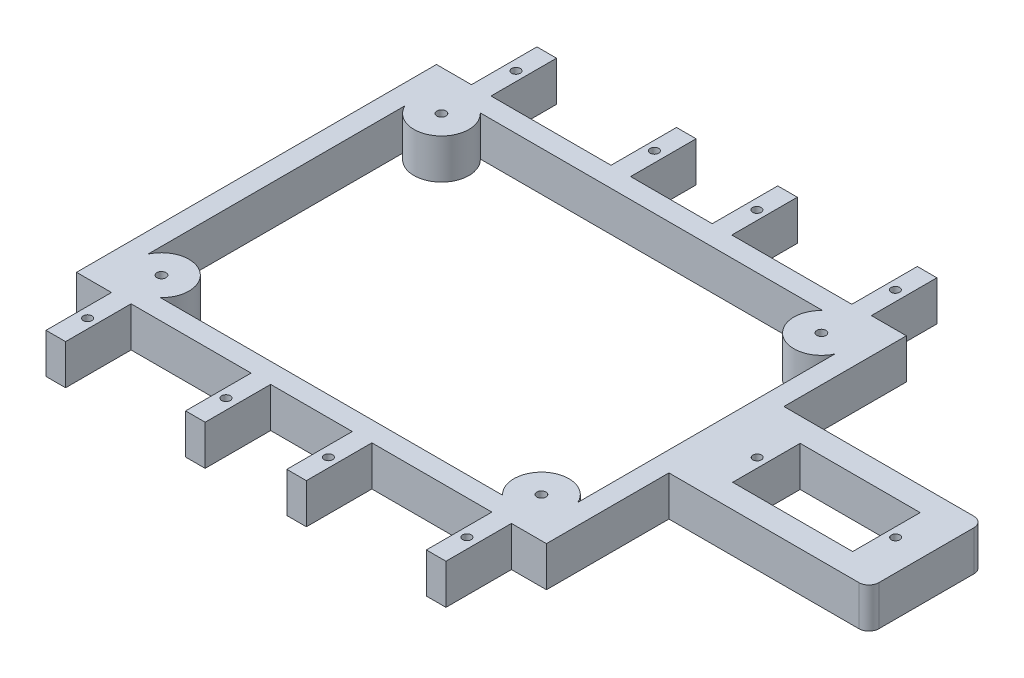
ISO-10303-21;
HEADER;
FILE_DESCRIPTION(('STEP AP214'),'2;1');
FILE_NAME('part.step','',(''),(''),'','','');
FILE_SCHEMA(('AUTOMOTIVE_DESIGN { 1 0 10303 214 1 1 1 1 }'));
ENDSEC;
DATA;
#1=APPLICATION_CONTEXT('core data for automotive mechanical design processes');
#2=APPLICATION_PROTOCOL_DEFINITION('international standard','automotive_design',2000,#1);
#3=PRODUCT_CONTEXT('',#1,'mechanical');
#4=PRODUCT('Part','Part','',(#3));
#5=PRODUCT_RELATED_PRODUCT_CATEGORY('part','',(#4));
#6=PRODUCT_DEFINITION_FORMATION('','',#4);
#7=PRODUCT_DEFINITION_CONTEXT('part definition',#1,'design');
#8=PRODUCT_DEFINITION('design','',#6,#7);
#9=PRODUCT_DEFINITION_SHAPE('','',#8);
#10=(LENGTH_UNIT() NAMED_UNIT(*) SI_UNIT(.MILLI.,.METRE.));
#11=(NAMED_UNIT(*) PLANE_ANGLE_UNIT() SI_UNIT($,.RADIAN.));
#12=(NAMED_UNIT(*) SI_UNIT($,.STERADIAN.) SOLID_ANGLE_UNIT());
#13=UNCERTAINTY_MEASURE_WITH_UNIT(LENGTH_MEASURE(1.E-05),#10,'distance_accuracy_value','');
#14=(GEOMETRIC_REPRESENTATION_CONTEXT(3) GLOBAL_UNCERTAINTY_ASSIGNED_CONTEXT((#13)) GLOBAL_UNIT_ASSIGNED_CONTEXT((#10,
#11,#12)) REPRESENTATION_CONTEXT('',''));
#15=CARTESIAN_POINT('',(0.,0.,0.));
#16=DIRECTION('',(0.,0.,1.));
#17=DIRECTION('',(1.,0.,0.));
#18=AXIS2_PLACEMENT_3D('',#15,#16,#17);
#19=CARTESIAN_POINT('',(47.,8.,-36.));
#20=DIRECTION('',(-1.,0.,0.));
#21=DIRECTION('',(0.,0.,1.));
#22=AXIS2_PLACEMENT_3D('',#19,#20,#21);
#23=PLANE('',#22);
#24=DIRECTION('',(0.,-1.,0.));
#25=VECTOR('',#24,1.);
#26=CARTESIAN_POINT('',(47.,8.,11.5));
#27=LINE('',#26,#25);
#28=CARTESIAN_POINT('',(47.,8.,11.5));
#29=VERTEX_POINT('',#28);
#30=CARTESIAN_POINT('',(47.,0.,11.5));
#31=VERTEX_POINT('',#30);
#32=EDGE_CURVE('E418',#29,#31,#27,.T.);
#33=ORIENTED_EDGE('',*,*,#32,.F.);
#34=DIRECTION('',(0.,0.,-1.));
#35=VECTOR('',#34,1.);
#36=CARTESIAN_POINT('',(47.,8.,-36.));
#37=LINE('',#36,#35);
#38=CARTESIAN_POINT('',(47.,8.,36.));
#39=VERTEX_POINT('',#38);
#40=EDGE_CURVE('E798',#39,#29,#37,.T.);
#41=ORIENTED_EDGE('',*,*,#40,.F.);
#42=DIRECTION('',(0.,-1.,0.));
#43=VECTOR('',#42,1.);
#44=CARTESIAN_POINT('',(47.,8.,36.));
#45=LINE('',#44,#43);
#46=CARTESIAN_POINT('',(47.,0.,36.));
#47=VERTEX_POINT('',#46);
#48=EDGE_CURVE('E821',#39,#47,#45,.T.);
#49=ORIENTED_EDGE('',*,*,#48,.T.);
#50=DIRECTION('',(0.,0.,-1.));
#51=VECTOR('',#50,1.);
#52=CARTESIAN_POINT('',(47.,0.,-36.));
#53=LINE('',#52,#51);
#54=EDGE_CURVE('E815',#47,#31,#53,.T.);
#55=ORIENTED_EDGE('',*,*,#54,.T.);
#56=EDGE_LOOP('',(#33,#41,#49,#55));
#57=FACE_BOUND('',#56,.T.);
#58=ADVANCED_FACE('F33',(#57),#23,.F.);
#59=DIRECTION('',(0.,1.,0.));
#60=VECTOR('',#59,1.);
#61=CARTESIAN_POINT('',(47.,8.,-11.5));
#62=LINE('',#61,#60);
#63=CARTESIAN_POINT('',(47.,0.,-11.5));
#64=VERTEX_POINT('',#63);
#65=CARTESIAN_POINT('',(47.,8.,-11.5));
#66=VERTEX_POINT('',#65);
#67=EDGE_CURVE('E426',#64,#66,#62,.T.);
#68=ORIENTED_EDGE('',*,*,#67,.F.);
#69=CARTESIAN_POINT('',(47.,0.,-36.));
#70=VERTEX_POINT('',#69);
#71=EDGE_CURVE('E812',#64,#70,#53,.T.);
#72=ORIENTED_EDGE('',*,*,#71,.T.);
#73=DIRECTION('',(0.,-1.,0.));
#74=VECTOR('',#73,1.);
#75=CARTESIAN_POINT('',(47.,8.,-36.));
#76=LINE('',#75,#74);
#77=CARTESIAN_POINT('',(47.,8.,-36.));
#78=VERTEX_POINT('',#77);
#79=EDGE_CURVE('E801',#78,#70,#76,.T.);
#80=ORIENTED_EDGE('',*,*,#79,.F.);
#81=EDGE_CURVE('E795',#66,#78,#37,.T.);
#82=ORIENTED_EDGE('',*,*,#81,.F.);
#83=EDGE_LOOP('',(#68,#72,#80,#82));
#84=FACE_BOUND('',#83,.T.);
#85=ADVANCED_FACE('F866',(#84),#23,.F.);
#86=CARTESIAN_POINT('',(-47.,8.,-36.));
#87=DIRECTION('',(0.,0.,1.));
#88=DIRECTION('',(1.,0.,0.));
#89=AXIS2_PLACEMENT_3D('',#86,#87,#88);
#90=PLANE('',#89);
#91=DIRECTION('',(-1.,0.,0.));
#92=VECTOR('',#91,1.);
#93=CARTESIAN_POINT('',(-47.,8.,-36.));
#94=LINE('',#93,#92);
#95=CARTESIAN_POINT('',(8.16462941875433,8.,-36.));
#96=VERTEX_POINT('',#95);
#97=CARTESIAN_POINT('',(-8.16462941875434,8.,-36.));
#98=VERTEX_POINT('',#97);
#99=EDGE_CURVE('E788',#96,#98,#94,.T.);
#100=ORIENTED_EDGE('',*,*,#99,.F.);
#101=DIRECTION('',(0.,1.,0.));
#102=VECTOR('',#101,1.);
#103=CARTESIAN_POINT('',(8.16462941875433,-13.6732680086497,-36.));
#104=LINE('',#103,#102);
#105=CARTESIAN_POINT('',(8.16462941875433,0.,-36.));
#106=VERTEX_POINT('',#105);
#107=EDGE_CURVE('E524',#106,#96,#104,.T.);
#108=ORIENTED_EDGE('',*,*,#107,.F.);
#109=DIRECTION('',(-1.,0.,0.));
#110=VECTOR('',#109,1.);
#111=CARTESIAN_POINT('',(-47.,0.,-36.));
#112=LINE('',#111,#110);
#113=CARTESIAN_POINT('',(-8.16462941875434,0.,-36.));
#114=VERTEX_POINT('',#113);
#115=EDGE_CURVE('E806',#106,#114,#112,.T.);
#116=ORIENTED_EDGE('',*,*,#115,.T.);
#117=DIRECTION('',(0.,1.,0.));
#118=VECTOR('',#117,1.);
#119=CARTESIAN_POINT('',(-8.16462941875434,-13.6732680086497,-36.));
#120=LINE('',#119,#118);
#121=EDGE_CURVE('E612',#114,#98,#120,.T.);
#122=ORIENTED_EDGE('',*,*,#121,.T.);
#123=EDGE_LOOP('',(#100,#108,#116,#122));
#124=FACE_BOUND('',#123,.T.);
#125=ADVANCED_FACE('F970',(#124),#90,.F.);
#126=CARTESIAN_POINT('',(36.0823147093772,0.,-36.));
#127=VERTEX_POINT('',#126);
#128=CARTESIAN_POINT('',(12.0823147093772,0.,-36.));
#129=VERTEX_POINT('',#128);
#130=EDGE_CURVE('E805',#127,#129,#112,.T.);
#131=ORIENTED_EDGE('',*,*,#130,.T.);
#132=DIRECTION('',(0.,1.,0.));
#133=VECTOR('',#132,1.);
#134=CARTESIAN_POINT('',(12.0823147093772,-13.6732680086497,-36.));
#135=LINE('',#134,#133);
#136=CARTESIAN_POINT('',(12.0823147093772,8.,-36.));
#137=VERTEX_POINT('',#136);
#138=EDGE_CURVE('E499',#129,#137,#135,.T.);
#139=ORIENTED_EDGE('',*,*,#138,.T.);
#140=CARTESIAN_POINT('',(36.0823147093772,8.,-36.));
#141=VERTEX_POINT('',#140);
#142=EDGE_CURVE('E787',#141,#137,#94,.T.);
#143=ORIENTED_EDGE('',*,*,#142,.F.);
#144=DIRECTION('',(0.,1.,0.));
#145=VECTOR('',#144,1.);
#146=CARTESIAN_POINT('',(36.0823147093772,-13.6732680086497,-36.));
#147=LINE('',#146,#145);
#148=EDGE_CURVE('E552',#127,#141,#147,.T.);
#149=ORIENTED_EDGE('',*,*,#148,.F.);
#150=EDGE_LOOP('',(#131,#139,#143,#149));
#151=FACE_BOUND('',#150,.T.);
#152=ADVANCED_FACE('F889',(#151),#90,.F.);
#153=CARTESIAN_POINT('',(-12.0823147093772,0.,-36.));
#154=VERTEX_POINT('',#153);
#155=CARTESIAN_POINT('',(-36.0823147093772,0.,-36.));
#156=VERTEX_POINT('',#155);
#157=EDGE_CURVE('E807',#154,#156,#112,.T.);
#158=ORIENTED_EDGE('',*,*,#157,.T.);
#159=DIRECTION('',(0.,1.,0.));
#160=VECTOR('',#159,1.);
#161=CARTESIAN_POINT('',(-36.0823147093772,-13.6732680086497,-36.));
#162=LINE('',#161,#160);
#163=CARTESIAN_POINT('',(-36.0823147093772,8.,-36.));
#164=VERTEX_POINT('',#163);
#165=EDGE_CURVE('E593',#156,#164,#162,.T.);
#166=ORIENTED_EDGE('',*,*,#165,.T.);
#167=CARTESIAN_POINT('',(-12.0823147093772,8.,-36.));
#168=VERTEX_POINT('',#167);
#169=EDGE_CURVE('E789',#168,#164,#94,.T.);
#170=ORIENTED_EDGE('',*,*,#169,.F.);
#171=DIRECTION('',(0.,1.,0.));
#172=VECTOR('',#171,1.);
#173=CARTESIAN_POINT('',(-12.0823147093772,-13.6732680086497,-36.));
#174=LINE('',#173,#172);
#175=EDGE_CURVE('E617',#154,#168,#174,.T.);
#176=ORIENTED_EDGE('',*,*,#175,.F.);
#177=EDGE_LOOP('',(#158,#166,#170,#176));
#178=FACE_BOUND('',#177,.T.);
#179=ADVANCED_FACE('F988',(#178),#90,.F.);
#180=CARTESIAN_POINT('',(-40.,8.,-36.));
#181=VERTEX_POINT('',#180);
#182=CARTESIAN_POINT('',(-47.,8.,-36.));
#183=VERTEX_POINT('',#182);
#184=EDGE_CURVE('E818',#181,#183,#94,.T.);
#185=ORIENTED_EDGE('',*,*,#184,.F.);
#186=DIRECTION('',(0.,1.,0.));
#187=VECTOR('',#186,1.);
#188=CARTESIAN_POINT('',(-40.,-13.6732680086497,-36.));
#189=LINE('',#188,#187);
#190=CARTESIAN_POINT('',(-40.,0.,-36.));
#191=VERTEX_POINT('',#190);
#192=EDGE_CURVE('E586',#191,#181,#189,.T.);
#193=ORIENTED_EDGE('',*,*,#192,.F.);
#194=CARTESIAN_POINT('',(-47.,0.,-36.));
#195=VERTEX_POINT('',#194);
#196=EDGE_CURVE('E774',#191,#195,#112,.T.);
#197=ORIENTED_EDGE('',*,*,#196,.T.);
#198=DIRECTION('',(0.,-1.,0.));
#199=VECTOR('',#198,1.);
#200=CARTESIAN_POINT('',(-47.,8.,-36.));
#201=LINE('',#200,#199);
#202=EDGE_CURVE('E827',#183,#195,#201,.T.);
#203=ORIENTED_EDGE('',*,*,#202,.F.);
#204=EDGE_LOOP('',(#185,#193,#197,#203));
#205=FACE_BOUND('',#204,.T.);
#206=ADVANCED_FACE('F913',(#205),#90,.F.);
#207=CARTESIAN_POINT('',(-47.,8.,36.));
#208=DIRECTION('',(0.,0.,-1.));
#209=DIRECTION('',(-1.,0.,0.));
#210=AXIS2_PLACEMENT_3D('',#207,#208,#209);
#211=PLANE('',#210);
#212=DIRECTION('',(1.,0.,0.));
#213=VECTOR('',#212,1.);
#214=CARTESIAN_POINT('',(-47.,0.,36.));
#215=LINE('',#214,#213);
#216=CARTESIAN_POINT('',(-36.0823147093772,0.,36.));
#217=VERTEX_POINT('',#216);
#218=CARTESIAN_POINT('',(-12.0823147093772,0.,36.));
#219=VERTEX_POINT('',#218);
#220=EDGE_CURVE('E813',#217,#219,#215,.T.);
#221=ORIENTED_EDGE('',*,*,#220,.T.);
#222=DIRECTION('',(0.,1.,0.));
#223=VECTOR('',#222,1.);
#224=CARTESIAN_POINT('',(-12.0823147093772,-13.6732680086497,36.));
#225=LINE('',#224,#223);
#226=CARTESIAN_POINT('',(-12.0823147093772,8.,36.));
#227=VERTEX_POINT('',#226);
#228=EDGE_CURVE('E658',#219,#227,#225,.T.);
#229=ORIENTED_EDGE('',*,*,#228,.T.);
#230=DIRECTION('',(1.,0.,0.));
#231=VECTOR('',#230,1.);
#232=CARTESIAN_POINT('',(-47.,8.,36.));
#233=LINE('',#232,#231);
#234=CARTESIAN_POINT('',(-36.0823147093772,8.,36.));
#235=VERTEX_POINT('',#234);
#236=EDGE_CURVE('E796',#235,#227,#233,.T.);
#237=ORIENTED_EDGE('',*,*,#236,.F.);
#238=DIRECTION('',(0.,1.,0.));
#239=VECTOR('',#238,1.);
#240=CARTESIAN_POINT('',(-36.0823147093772,-13.6732680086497,36.));
#241=LINE('',#240,#239);
#242=EDGE_CURVE('E683',#217,#235,#241,.T.);
#243=ORIENTED_EDGE('',*,*,#242,.F.);
#244=EDGE_LOOP('',(#221,#229,#237,#243));
#245=FACE_BOUND('',#244,.T.);
#246=ADVANCED_FACE('F938',(#245),#211,.F.);
#247=CARTESIAN_POINT('',(-8.16462941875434,8.,36.));
#248=VERTEX_POINT('',#247);
#249=CARTESIAN_POINT('',(8.16462941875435,8.,36.));
#250=VERTEX_POINT('',#249);
#251=EDGE_CURVE('E797',#248,#250,#233,.T.);
#252=ORIENTED_EDGE('',*,*,#251,.F.);
#253=DIRECTION('',(0.,1.,0.));
#254=VECTOR('',#253,1.);
#255=CARTESIAN_POINT('',(-8.16462941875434,-13.6732680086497,36.));
#256=LINE('',#255,#254);
#257=CARTESIAN_POINT('',(-8.16462941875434,0.,36.));
#258=VERTEX_POINT('',#257);
#259=EDGE_CURVE('E651',#258,#248,#256,.T.);
#260=ORIENTED_EDGE('',*,*,#259,.F.);
#261=CARTESIAN_POINT('',(8.16462941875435,0.,36.));
#262=VERTEX_POINT('',#261);
#263=EDGE_CURVE('E814',#258,#262,#215,.T.);
#264=ORIENTED_EDGE('',*,*,#263,.T.);
#265=DIRECTION('',(0.,1.,0.));
#266=VECTOR('',#265,1.);
#267=CARTESIAN_POINT('',(8.16462941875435,-13.6732680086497,36.));
#268=LINE('',#267,#266);
#269=EDGE_CURVE('E710',#262,#250,#268,.T.);
#270=ORIENTED_EDGE('',*,*,#269,.T.);
#271=EDGE_LOOP('',(#252,#260,#264,#270));
#272=FACE_BOUND('',#271,.T.);
#273=ADVANCED_FACE('F993',(#272),#211,.F.);
#274=CARTESIAN_POINT('',(12.0823147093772,8.,36.));
#275=VERTEX_POINT('',#274);
#276=CARTESIAN_POINT('',(36.0823147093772,8.,36.));
#277=VERTEX_POINT('',#276);
#278=EDGE_CURVE('E941',#275,#277,#233,.T.);
#279=ORIENTED_EDGE('',*,*,#278,.F.);
#280=DIRECTION('',(0.,1.,0.));
#281=VECTOR('',#280,1.);
#282=CARTESIAN_POINT('',(12.0823147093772,-13.6732680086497,36.));
#283=LINE('',#282,#281);
#284=CARTESIAN_POINT('',(12.0823147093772,0.,36.));
#285=VERTEX_POINT('',#284);
#286=EDGE_CURVE('E716',#285,#275,#283,.T.);
#287=ORIENTED_EDGE('',*,*,#286,.F.);
#288=CARTESIAN_POINT('',(36.0823147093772,0.,36.));
#289=VERTEX_POINT('',#288);
#290=EDGE_CURVE('E1658',#285,#289,#215,.T.);
#291=ORIENTED_EDGE('',*,*,#290,.T.);
#292=DIRECTION('',(0.,1.,0.));
#293=VECTOR('',#292,1.);
#294=CARTESIAN_POINT('',(36.0823147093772,-13.6732680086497,36.));
#295=LINE('',#294,#293);
#296=EDGE_CURVE('E757',#289,#277,#295,.T.);
#297=ORIENTED_EDGE('',*,*,#296,.T.);
#298=EDGE_LOOP('',(#279,#287,#291,#297));
#299=FACE_BOUND('',#298,.T.);
#300=ADVANCED_FACE('F1101',(#299),#211,.F.);
#301=DIRECTION('',(0.,1.,0.));
#302=VECTOR('',#301,1.);
#303=CARTESIAN_POINT('',(40.,-13.6732680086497,36.));
#304=LINE('',#303,#302);
#305=CARTESIAN_POINT('',(40.,0.,36.));
#306=VERTEX_POINT('',#305);
#307=CARTESIAN_POINT('',(40.,8.,36.));
#308=VERTEX_POINT('',#307);
#309=EDGE_CURVE('E751',#306,#308,#304,.T.);
#310=ORIENTED_EDGE('',*,*,#309,.F.);
#311=EDGE_CURVE('E809',#306,#47,#215,.T.);
#312=ORIENTED_EDGE('',*,*,#311,.T.);
#313=ORIENTED_EDGE('',*,*,#48,.F.);
#314=EDGE_CURVE('E791',#308,#39,#233,.T.);
#315=ORIENTED_EDGE('',*,*,#314,.F.);
#316=EDGE_LOOP('',(#310,#312,#313,#315));
#317=FACE_BOUND('',#316,.T.);
#318=ADVANCED_FACE('F950',(#317),#211,.F.);
#319=CARTESIAN_POINT('',(0.,8.,0.));
#320=DIRECTION('',(0.,-1.,0.));
#321=DIRECTION('',(0.,0.,-1.));
#322=AXIS2_PLACEMENT_3D('',#319,#320,#321);
#323=PLANE('',#322);
#324=CARTESIAN_POINT('',(80.85,8.,0.));
#325=DIRECTION('',(0.,1.,0.));
#326=DIRECTION('',(0.,0.,1.));
#327=AXIS2_PLACEMENT_3D('',#324,#325,#326);
#328=CIRCLE('',#327,0.850000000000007);
#329=CARTESIAN_POINT('',(80.85,8.,0.850000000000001));
#330=VERTEX_POINT('',#329);
#331=EDGE_CURVE('E412',#330,#330,#328,.T.);
#332=ORIENTED_EDGE('',*,*,#331,.F.);
#333=EDGE_LOOP('',(#332));
#334=FACE_BOUND('',#333,.T.);
#335=CARTESIAN_POINT('',(53.15,8.,0.));
#336=DIRECTION('',(0.,1.,0.));
#337=DIRECTION('',(0.,0.,1.));
#338=AXIS2_PLACEMENT_3D('',#335,#336,#337);
#339=CIRCLE('',#338,0.849999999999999);
#340=CARTESIAN_POINT('',(53.15,8.,0.849999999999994));
#341=VERTEX_POINT('',#340);
#342=EDGE_CURVE('E1108',#341,#341,#339,.T.);
#343=ORIENTED_EDGE('',*,*,#342,.F.);
#344=EDGE_LOOP('',(#343));
#345=FACE_BOUND('',#344,.T.);
#346=DIRECTION('',(-1.,0.,0.));
#347=VECTOR('',#346,1.);
#348=CARTESIAN_POINT('',(55.,8.,-6.75000000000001));
#349=LINE('',#348,#347);
#350=CARTESIAN_POINT('',(79.,8.,-6.75000000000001));
#351=VERTEX_POINT('',#350);
#352=CARTESIAN_POINT('',(55.,8.,-6.75000000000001));
#353=VERTEX_POINT('',#352);
#354=EDGE_CURVE('E411',#351,#353,#349,.T.);
#355=ORIENTED_EDGE('',*,*,#354,.F.);
#356=DIRECTION('',(0.,0.,-1.));
#357=VECTOR('',#356,1.);
#358=CARTESIAN_POINT('',(79.,8.,-6.75000000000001));
#359=LINE('',#358,#357);
#360=CARTESIAN_POINT('',(79.,8.,6.74999999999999));
#361=VERTEX_POINT('',#360);
#362=EDGE_CURVE('E381',#361,#351,#359,.T.);
#363=ORIENTED_EDGE('',*,*,#362,.F.);
#364=DIRECTION('',(1.,0.,0.));
#365=VECTOR('',#364,1.);
#366=CARTESIAN_POINT('',(55.,8.,6.74999999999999));
#367=LINE('',#366,#365);
#368=CARTESIAN_POINT('',(55.,8.,6.74999999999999));
#369=VERTEX_POINT('',#368);
#370=EDGE_CURVE('E399',#369,#361,#367,.T.);
#371=ORIENTED_EDGE('',*,*,#370,.F.);
#372=DIRECTION('',(0.,0.,1.));
#373=VECTOR('',#372,1.);
#374=CARTESIAN_POINT('',(55.,8.,-6.75000000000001));
#375=LINE('',#374,#373);
#376=EDGE_CURVE('E402',#353,#369,#375,.T.);
#377=ORIENTED_EDGE('',*,*,#376,.F.);
#378=EDGE_LOOP('',(#355,#363,#371,#377));
#379=FACE_BOUND('',#378,.T.);
#380=DIRECTION('',(0.,0.,1.));
#381=VECTOR('',#380,1.);
#382=CARTESIAN_POINT('',(87.,8.,11.5));
#383=LINE('',#382,#381);
#384=CARTESIAN_POINT('',(87.,8.,-9.50000000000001));
#385=VERTEX_POINT('',#384);
#386=CARTESIAN_POINT('',(87.,8.,9.49999999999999));
#387=VERTEX_POINT('',#386);
#388=EDGE_CURVE('E425',#385,#387,#383,.T.);
#389=ORIENTED_EDGE('',*,*,#388,.F.);
#390=CARTESIAN_POINT('',(85.,8.,-9.50000000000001));
#391=DIRECTION('',(0.,-1.,0.));
#392=DIRECTION('',(0.,0.,-1.));
#393=AXIS2_PLACEMENT_3D('',#390,#391,#392);
#394=CIRCLE('',#393,2.);
#395=CARTESIAN_POINT('',(85.,8.,-11.5));
#396=VERTEX_POINT('',#395);
#397=EDGE_CURVE('E846',#385,#396,#394,.F.);
#398=ORIENTED_EDGE('',*,*,#397,.T.);
#399=DIRECTION('',(-1.,0.,0.));
#400=VECTOR('',#399,1.);
#401=CARTESIAN_POINT('',(87.,8.,-11.5));
#402=LINE('',#401,#400);
#403=EDGE_CURVE('E435',#396,#66,#402,.T.);
#404=ORIENTED_EDGE('',*,*,#403,.T.);
#405=ORIENTED_EDGE('',*,*,#81,.T.);
#406=CARTESIAN_POINT('',(40.,8.,-36.));
#407=VERTEX_POINT('',#406);
#408=EDGE_CURVE('E783',#78,#407,#94,.T.);
#409=ORIENTED_EDGE('',*,*,#408,.T.);
#410=DIRECTION('',(0.,0.,-1.));
#411=VECTOR('',#410,1.);
#412=CARTESIAN_POINT('',(40.,8.,-36.));
#413=LINE('',#412,#411);
#414=CARTESIAN_POINT('',(40.,8.,-49.1));
#415=VERTEX_POINT('',#414);
#416=EDGE_CURVE('E537',#407,#415,#413,.T.);
#417=ORIENTED_EDGE('',*,*,#416,.T.);
#418=DIRECTION('',(-1.,0.,0.));
#419=VECTOR('',#418,1.);
#420=CARTESIAN_POINT('',(36.0823147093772,8.,-49.1));
#421=LINE('',#420,#419);
#422=CARTESIAN_POINT('',(36.0823147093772,8.,-49.1));
#423=VERTEX_POINT('',#422);
#424=EDGE_CURVE('E533',#415,#423,#421,.T.);
#425=ORIENTED_EDGE('',*,*,#424,.T.);
#426=DIRECTION('',(0.,0.,1.));
#427=VECTOR('',#426,1.);
#428=CARTESIAN_POINT('',(36.0823147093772,8.,-36.));
#429=LINE('',#428,#427);
#430=EDGE_CURVE('E540',#423,#141,#429,.T.);
#431=ORIENTED_EDGE('',*,*,#430,.T.);
#432=ORIENTED_EDGE('',*,*,#142,.T.);
#433=DIRECTION('',(0.,0.,-1.));
#434=VECTOR('',#433,1.);
#435=CARTESIAN_POINT('',(12.0823147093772,8.,-36.));
#436=LINE('',#435,#434);
#437=CARTESIAN_POINT('',(12.0823147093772,8.,-49.1));
#438=VERTEX_POINT('',#437);
#439=EDGE_CURVE('E507',#137,#438,#436,.T.);
#440=ORIENTED_EDGE('',*,*,#439,.T.);
#441=DIRECTION('',(-1.,0.,0.));
#442=VECTOR('',#441,1.);
#443=CARTESIAN_POINT('',(12.0823147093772,8.,-49.1));
#444=LINE('',#443,#442);
#445=CARTESIAN_POINT('',(8.16462941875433,8.,-49.1));
#446=VERTEX_POINT('',#445);
#447=EDGE_CURVE('E504',#438,#446,#444,.T.);
#448=ORIENTED_EDGE('',*,*,#447,.T.);
#449=DIRECTION('',(0.,0.,1.));
#450=VECTOR('',#449,1.);
#451=CARTESIAN_POINT('',(8.16462941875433,8.,-36.));
#452=LINE('',#451,#450);
#453=EDGE_CURVE('E500',#446,#96,#452,.T.);
#454=ORIENTED_EDGE('',*,*,#453,.T.);
#455=ORIENTED_EDGE('',*,*,#99,.T.);
#456=DIRECTION('',(0.,0.,-1.));
#457=VECTOR('',#456,1.);
#458=CARTESIAN_POINT('',(-8.16462941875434,8.,-36.));
#459=LINE('',#458,#457);
#460=CARTESIAN_POINT('',(-8.16462941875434,8.,-49.1));
#461=VERTEX_POINT('',#460);
#462=EDGE_CURVE('E603',#98,#461,#459,.T.);
#463=ORIENTED_EDGE('',*,*,#462,.T.);
#464=DIRECTION('',(-1.,0.,0.));
#465=VECTOR('',#464,1.);
#466=CARTESIAN_POINT('',(-12.0823147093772,8.,-49.1));
#467=LINE('',#466,#465);
#468=CARTESIAN_POINT('',(-12.0823147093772,8.,-49.1));
#469=VERTEX_POINT('',#468);
#470=EDGE_CURVE('E599',#461,#469,#467,.T.);
#471=ORIENTED_EDGE('',*,*,#470,.T.);
#472=DIRECTION('',(0.,0.,1.));
#473=VECTOR('',#472,1.);
#474=CARTESIAN_POINT('',(-12.0823147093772,8.,-36.));
#475=LINE('',#474,#473);
#476=EDGE_CURVE('E606',#469,#168,#475,.T.);
#477=ORIENTED_EDGE('',*,*,#476,.T.);
#478=ORIENTED_EDGE('',*,*,#169,.T.);
#479=DIRECTION('',(0.,0.,-1.));
#480=VECTOR('',#479,1.);
#481=CARTESIAN_POINT('',(-36.0823147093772,8.,-36.));
#482=LINE('',#481,#480);
#483=CARTESIAN_POINT('',(-36.0823147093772,8.,-49.1));
#484=VERTEX_POINT('',#483);
#485=EDGE_CURVE('E573',#164,#484,#482,.T.);
#486=ORIENTED_EDGE('',*,*,#485,.T.);
#487=DIRECTION('',(-1.,0.,0.));
#488=VECTOR('',#487,1.);
#489=CARTESIAN_POINT('',(-36.0823147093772,8.,-49.1));
#490=LINE('',#489,#488);
#491=CARTESIAN_POINT('',(-40.,8.,-49.1));
#492=VERTEX_POINT('',#491);
#493=EDGE_CURVE('E570',#484,#492,#490,.T.);
#494=ORIENTED_EDGE('',*,*,#493,.T.);
#495=DIRECTION('',(0.,0.,1.));
#496=VECTOR('',#495,1.);
#497=CARTESIAN_POINT('',(-40.,8.,-36.));
#498=LINE('',#497,#496);
#499=EDGE_CURVE('E566',#492,#181,#498,.T.);
#500=ORIENTED_EDGE('',*,*,#499,.T.);
#501=ORIENTED_EDGE('',*,*,#184,.T.);
#502=DIRECTION('',(0.,0.,1.));
#503=VECTOR('',#502,1.);
#504=CARTESIAN_POINT('',(-47.,8.,-36.));
#505=LINE('',#504,#503);
#506=CARTESIAN_POINT('',(-47.,8.,36.));
#507=VERTEX_POINT('',#506);
#508=EDGE_CURVE('E786',#183,#507,#505,.T.);
#509=ORIENTED_EDGE('',*,*,#508,.T.);
#510=CARTESIAN_POINT('',(-40.,8.,36.));
#511=VERTEX_POINT('',#510);
#512=EDGE_CURVE('E792',#507,#511,#233,.T.);
#513=ORIENTED_EDGE('',*,*,#512,.T.);
#514=DIRECTION('',(0.,0.,1.));
#515=VECTOR('',#514,1.);
#516=CARTESIAN_POINT('',(-40.,8.,36.));
#517=LINE('',#516,#515);
#518=CARTESIAN_POINT('',(-40.,8.,49.1));
#519=VERTEX_POINT('',#518);
#520=EDGE_CURVE('E668',#511,#519,#517,.T.);
#521=ORIENTED_EDGE('',*,*,#520,.T.);
#522=DIRECTION('',(1.,0.,0.));
#523=VECTOR('',#522,1.);
#524=CARTESIAN_POINT('',(-36.0823147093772,8.,49.1));
#525=LINE('',#524,#523);
#526=CARTESIAN_POINT('',(-36.0823147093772,8.,49.1));
#527=VERTEX_POINT('',#526);
#528=EDGE_CURVE('E664',#519,#527,#525,.T.);
#529=ORIENTED_EDGE('',*,*,#528,.T.);
#530=DIRECTION('',(0.,0.,-1.));
#531=VECTOR('',#530,1.);
#532=CARTESIAN_POINT('',(-36.0823147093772,8.,36.));
#533=LINE('',#532,#531);
#534=EDGE_CURVE('E671',#527,#235,#533,.T.);
#535=ORIENTED_EDGE('',*,*,#534,.T.);
#536=ORIENTED_EDGE('',*,*,#236,.T.);
#537=DIRECTION('',(0.,0.,1.));
#538=VECTOR('',#537,1.);
#539=CARTESIAN_POINT('',(-12.0823147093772,8.,36.));
#540=LINE('',#539,#538);
#541=CARTESIAN_POINT('',(-12.0823147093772,8.,49.1));
#542=VERTEX_POINT('',#541);
#543=EDGE_CURVE('E638',#227,#542,#540,.T.);
#544=ORIENTED_EDGE('',*,*,#543,.T.);
#545=DIRECTION('',(1.,0.,0.));
#546=VECTOR('',#545,1.);
#547=CARTESIAN_POINT('',(-12.0823147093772,8.,49.1));
#548=LINE('',#547,#546);
#549=CARTESIAN_POINT('',(-8.16462941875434,8.,49.1));
#550=VERTEX_POINT('',#549);
#551=EDGE_CURVE('E635',#542,#550,#548,.T.);
#552=ORIENTED_EDGE('',*,*,#551,.T.);
#553=DIRECTION('',(0.,0.,-1.));
#554=VECTOR('',#553,1.);
#555=CARTESIAN_POINT('',(-8.16462941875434,8.,36.));
#556=LINE('',#555,#554);
#557=EDGE_CURVE('E631',#550,#248,#556,.T.);
#558=ORIENTED_EDGE('',*,*,#557,.T.);
#559=ORIENTED_EDGE('',*,*,#251,.T.);
#560=DIRECTION('',(0.,0.,1.));
#561=VECTOR('',#560,1.);
#562=CARTESIAN_POINT('',(8.16462941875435,8.,36.));
#563=LINE('',#562,#561);
#564=CARTESIAN_POINT('',(8.16462941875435,8.,49.1));
#565=VERTEX_POINT('',#564);
#566=EDGE_CURVE('E701',#250,#565,#563,.T.);
#567=ORIENTED_EDGE('',*,*,#566,.T.);
#568=DIRECTION('',(1.,0.,0.));
#569=VECTOR('',#568,1.);
#570=CARTESIAN_POINT('',(12.0823147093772,8.,49.1));
#571=LINE('',#570,#569);
#572=CARTESIAN_POINT('',(12.0823147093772,8.,49.1));
#573=VERTEX_POINT('',#572);
#574=EDGE_CURVE('E697',#565,#573,#571,.T.);
#575=ORIENTED_EDGE('',*,*,#574,.T.);
#576=DIRECTION('',(0.,0.,-1.));
#577=VECTOR('',#576,1.);
#578=CARTESIAN_POINT('',(12.0823147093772,8.,36.));
#579=LINE('',#578,#577);
#580=EDGE_CURVE('E704',#573,#275,#579,.T.);
#581=ORIENTED_EDGE('',*,*,#580,.T.);
#582=ORIENTED_EDGE('',*,*,#278,.T.);
#583=DIRECTION('',(0.,0.,1.));
#584=VECTOR('',#583,1.);
#585=CARTESIAN_POINT('',(36.0823147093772,8.,36.));
#586=LINE('',#585,#584);
#587=CARTESIAN_POINT('',(36.0823147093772,8.,49.1));
#588=VERTEX_POINT('',#587);
#589=EDGE_CURVE('E738',#277,#588,#586,.T.);
#590=ORIENTED_EDGE('',*,*,#589,.T.);
#591=DIRECTION('',(1.,0.,0.));
#592=VECTOR('',#591,1.);
#593=CARTESIAN_POINT('',(36.0823147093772,8.,49.1));
#594=LINE('',#593,#592);
#595=CARTESIAN_POINT('',(40.,8.,49.1));
#596=VERTEX_POINT('',#595);
#597=EDGE_CURVE('E735',#588,#596,#594,.T.);
#598=ORIENTED_EDGE('',*,*,#597,.T.);
#599=DIRECTION('',(0.,0.,-1.));
#600=VECTOR('',#599,1.);
#601=CARTESIAN_POINT('',(40.,8.,36.));
#602=LINE('',#601,#600);
#603=EDGE_CURVE('E731',#596,#308,#602,.T.);
#604=ORIENTED_EDGE('',*,*,#603,.T.);
#605=ORIENTED_EDGE('',*,*,#314,.T.);
#606=ORIENTED_EDGE('',*,*,#40,.T.);
#607=DIRECTION('',(-1.,0.,0.));
#608=VECTOR('',#607,1.);
#609=CARTESIAN_POINT('',(87.,8.,11.5));
#610=LINE('',#609,#608);
#611=CARTESIAN_POINT('',(85.,8.,11.5));
#612=VERTEX_POINT('',#611);
#613=EDGE_CURVE('E429',#612,#29,#610,.T.);
#614=ORIENTED_EDGE('',*,*,#613,.F.);
#615=CARTESIAN_POINT('',(85.,8.,9.49999999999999));
#616=DIRECTION('',(0.,-1.,0.));
#617=DIRECTION('',(0.,0.,-1.));
#618=AXIS2_PLACEMENT_3D('',#615,#616,#617);
#619=CIRCLE('',#618,2.);
#620=EDGE_CURVE('E844',#612,#387,#619,.F.);
#621=ORIENTED_EDGE('',*,*,#620,.T.);
#622=EDGE_LOOP('',(#389,#398,#404,#405,#409,#417,#425,#431,#432,#440,#448,#454,#455,#463,#471,
#477,#478,#486,#494,#500,#501,#509,#513,#521,#529,#535,#536,#544,#552,#558,#559,#567,#575,#581,
#582,#590,#598,#604,#605,#606,#614,#621));
#623=FACE_BOUND('',#622,.T.);
#624=DIRECTION('',(-1.,0.,0.));
#625=VECTOR('',#624,1.);
#626=CARTESIAN_POINT('',(-43.,8.,-32.));
#627=LINE('',#626,#625);
#628=CARTESIAN_POINT('',(34.2250827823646,8.,-32.));
#629=VERTEX_POINT('',#628);
#630=CARTESIAN_POINT('',(-34.2250827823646,8.,-32.));
#631=VERTEX_POINT('',#630);
#632=EDGE_CURVE('E766',#629,#631,#627,.T.);
#633=ORIENTED_EDGE('',*,*,#632,.F.);
#634=CARTESIAN_POINT('',(38.,8.,-28.));
#635=DIRECTION('',(0.,-1.,0.));
#636=DIRECTION('',(0.,0.,-1.));
#637=AXIS2_PLACEMENT_3D('',#634,#635,#636);
#638=CIRCLE('',#637,5.5);
#639=CARTESIAN_POINT('',(43.,8.,-25.7087121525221));
#640=VERTEX_POINT('',#639);
#641=EDGE_CURVE('E442',#629,#640,#638,.F.);
#642=ORIENTED_EDGE('',*,*,#641,.T.);
#643=DIRECTION('',(0.,0.,-1.));
#644=VECTOR('',#643,1.);
#645=CARTESIAN_POINT('',(43.,8.,-32.));
#646=LINE('',#645,#644);
#647=CARTESIAN_POINT('',(43.,8.,25.7087121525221));
#648=VERTEX_POINT('',#647);
#649=EDGE_CURVE('E763',#648,#640,#646,.T.);
#650=ORIENTED_EDGE('',*,*,#649,.F.);
#651=CARTESIAN_POINT('',(38.,8.,28.));
#652=DIRECTION('',(0.,-1.,0.));
#653=DIRECTION('',(0.,0.,-1.));
#654=AXIS2_PLACEMENT_3D('',#651,#652,#653);
#655=CIRCLE('',#654,5.5);
#656=CARTESIAN_POINT('',(34.2250827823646,8.,32.));
#657=VERTEX_POINT('',#656);
#658=EDGE_CURVE('E471',#648,#657,#655,.F.);
#659=ORIENTED_EDGE('',*,*,#658,.T.);
#660=DIRECTION('',(1.,0.,0.));
#661=VECTOR('',#660,1.);
#662=CARTESIAN_POINT('',(-43.,8.,32.));
#663=LINE('',#662,#661);
#664=CARTESIAN_POINT('',(-34.2250827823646,8.,32.));
#665=VERTEX_POINT('',#664);
#666=EDGE_CURVE('E771',#665,#657,#663,.T.);
#667=ORIENTED_EDGE('',*,*,#666,.F.);
#668=CARTESIAN_POINT('',(-38.,8.,28.));
#669=DIRECTION('',(0.,-1.,0.));
#670=DIRECTION('',(0.,0.,-1.));
#671=AXIS2_PLACEMENT_3D('',#668,#669,#670);
#672=CIRCLE('',#671,5.5);
#673=CARTESIAN_POINT('',(-43.,8.,25.7087121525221));
#674=VERTEX_POINT('',#673);
#675=EDGE_CURVE('E485',#665,#674,#672,.F.);
#676=ORIENTED_EDGE('',*,*,#675,.T.);
#677=DIRECTION('',(0.,0.,1.));
#678=VECTOR('',#677,1.);
#679=CARTESIAN_POINT('',(-43.,8.,-32.));
#680=LINE('',#679,#678);
#681=CARTESIAN_POINT('',(-43.,8.,-25.7087121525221));
#682=VERTEX_POINT('',#681);
#683=EDGE_CURVE('E769',#682,#674,#680,.T.);
#684=ORIENTED_EDGE('',*,*,#683,.F.);
#685=CARTESIAN_POINT('',(-38.,8.,-28.));
#686=DIRECTION('',(0.,-1.,0.));
#687=DIRECTION('',(0.,0.,-1.));
#688=AXIS2_PLACEMENT_3D('',#685,#686,#687);
#689=CIRCLE('',#688,5.5);
#690=EDGE_CURVE('E456',#682,#631,#689,.F.);
#691=ORIENTED_EDGE('',*,*,#690,.T.);
#692=EDGE_LOOP('',(#633,#642,#650,#659,#667,#676,#684,#691));
#693=FACE_BOUND('',#692,.T.);
#694=CARTESIAN_POINT('',(37.9430671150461,8.,42.85));
#695=DIRECTION('',(0.,1.,0.));
#696=DIRECTION('',(0.,0.,1.));
#697=AXIS2_PLACEMENT_3D('',#694,#695,#696);
#698=CIRCLE('',#697,0.849999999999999);
#699=CARTESIAN_POINT('',(37.9430671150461,8.,43.7));
#700=VERTEX_POINT('',#699);
#701=EDGE_CURVE('E741',#700,#700,#698,.T.);
#702=ORIENTED_EDGE('',*,*,#701,.F.);
#703=EDGE_LOOP('',(#702));
#704=FACE_BOUND('',#703,.T.);
#705=CARTESIAN_POINT('',(10.2430671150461,8.,42.85));
#706=DIRECTION('',(0.,1.,0.));
#707=DIRECTION('',(0.,0.,1.));
#708=AXIS2_PLACEMENT_3D('',#705,#706,#707);
#709=CIRCLE('',#708,0.850000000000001);
#710=CARTESIAN_POINT('',(10.2430671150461,8.,43.7));
#711=VERTEX_POINT('',#710);
#712=EDGE_CURVE('E707',#711,#711,#709,.T.);
#713=ORIENTED_EDGE('',*,*,#712,.F.);
#714=EDGE_LOOP('',(#713));
#715=FACE_BOUND('',#714,.T.);
#716=CARTESIAN_POINT('',(-37.9430671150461,8.,42.85));
#717=DIRECTION('',(0.,1.,0.));
#718=DIRECTION('',(0.,0.,-1.));
#719=AXIS2_PLACEMENT_3D('',#716,#717,#718);
#720=CIRCLE('',#719,0.849999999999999);
#721=CARTESIAN_POINT('',(-37.9430671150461,8.,42.));
#722=VERTEX_POINT('',#721);
#723=EDGE_CURVE('E674',#722,#722,#720,.T.);
#724=ORIENTED_EDGE('',*,*,#723,.F.);
#725=EDGE_LOOP('',(#724));
#726=FACE_BOUND('',#725,.T.);
#727=CARTESIAN_POINT('',(-10.2430671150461,8.,42.85));
#728=DIRECTION('',(0.,1.,0.));
#729=DIRECTION('',(0.,0.,-1.));
#730=AXIS2_PLACEMENT_3D('',#727,#728,#729);
#731=CIRCLE('',#730,0.850000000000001);
#732=CARTESIAN_POINT('',(-10.2430671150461,8.,42.));
#733=VERTEX_POINT('',#732);
#734=EDGE_CURVE('E641',#733,#733,#731,.T.);
#735=ORIENTED_EDGE('',*,*,#734,.F.);
#736=EDGE_LOOP('',(#735));
#737=FACE_BOUND('',#736,.T.);
#738=CARTESIAN_POINT('',(-10.2430671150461,8.,-42.85));
#739=DIRECTION('',(0.,1.,0.));
#740=DIRECTION('',(0.,0.,1.));
#741=AXIS2_PLACEMENT_3D('',#738,#739,#740);
#742=CIRCLE('',#741,0.850000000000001);
#743=CARTESIAN_POINT('',(-10.2430671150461,8.,-42.));
#744=VERTEX_POINT('',#743);
#745=EDGE_CURVE('E609',#744,#744,#742,.T.);
#746=ORIENTED_EDGE('',*,*,#745,.F.);
#747=EDGE_LOOP('',(#746));
#748=FACE_BOUND('',#747,.T.);
#749=CARTESIAN_POINT('',(-37.9430671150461,8.,-42.85));
#750=DIRECTION('',(0.,1.,0.));
#751=DIRECTION('',(0.,0.,1.));
#752=AXIS2_PLACEMENT_3D('',#749,#750,#751);
#753=CIRCLE('',#752,0.849999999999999);
#754=CARTESIAN_POINT('',(-37.9430671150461,8.,-42.));
#755=VERTEX_POINT('',#754);
#756=EDGE_CURVE('E576',#755,#755,#753,.T.);
#757=ORIENTED_EDGE('',*,*,#756,.F.);
#758=EDGE_LOOP('',(#757));
#759=FACE_BOUND('',#758,.T.);
#760=CARTESIAN_POINT('',(37.9430671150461,8.,-42.85));
#761=DIRECTION('',(0.,1.,0.));
#762=DIRECTION('',(0.,0.,-1.));
#763=AXIS2_PLACEMENT_3D('',#760,#761,#762);
#764=CIRCLE('',#763,0.849999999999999);
#765=CARTESIAN_POINT('',(37.9430671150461,8.,-43.7));
#766=VERTEX_POINT('',#765);
#767=EDGE_CURVE('E543',#766,#766,#764,.T.);
#768=ORIENTED_EDGE('',*,*,#767,.F.);
#769=EDGE_LOOP('',(#768));
#770=FACE_BOUND('',#769,.T.);
#771=CARTESIAN_POINT('',(10.2430671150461,8.,-42.85));
#772=DIRECTION('',(0.,1.,0.));
#773=DIRECTION('',(0.,0.,-1.));
#774=AXIS2_PLACEMENT_3D('',#771,#772,#773);
#775=CIRCLE('',#774,0.850000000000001);
#776=CARTESIAN_POINT('',(10.2430671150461,8.,-43.7));
#777=VERTEX_POINT('',#776);
#778=EDGE_CURVE('E510',#777,#777,#775,.T.);
#779=ORIENTED_EDGE('',*,*,#778,.F.);
#780=EDGE_LOOP('',(#779));
#781=FACE_BOUND('',#780,.T.);
#782=CARTESIAN_POINT('',(-38.,8.,28.));
#783=DIRECTION('',(0.,-1.,0.));
#784=DIRECTION('',(0.,0.,-1.));
#785=AXIS2_PLACEMENT_3D('',#782,#783,#784);
#786=CIRCLE('',#785,0.899999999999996);
#787=CARTESIAN_POINT('',(-38.,8.,27.1));
#788=VERTEX_POINT('',#787);
#789=EDGE_CURVE('E489',#788,#788,#786,.F.);
#790=ORIENTED_EDGE('',*,*,#789,.F.);
#791=EDGE_LOOP('',(#790));
#792=FACE_BOUND('',#791,.T.);
#793=CARTESIAN_POINT('',(38.,8.,28.));
#794=DIRECTION('',(0.,-1.,0.));
#795=DIRECTION('',(0.,0.,-1.));
#796=AXIS2_PLACEMENT_3D('',#793,#794,#795);
#797=CIRCLE('',#796,0.899999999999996);
#798=CARTESIAN_POINT('',(38.,8.,27.1));
#799=VERTEX_POINT('',#798);
#800=EDGE_CURVE('E475',#799,#799,#797,.F.);
#801=ORIENTED_EDGE('',*,*,#800,.F.);
#802=EDGE_LOOP('',(#801));
#803=FACE_BOUND('',#802,.T.);
#804=CARTESIAN_POINT('',(-38.,8.,-28.));
#805=DIRECTION('',(0.,-1.,0.));
#806=DIRECTION('',(0.,0.,-1.));
#807=AXIS2_PLACEMENT_3D('',#804,#805,#806);
#808=CIRCLE('',#807,0.899999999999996);
#809=CARTESIAN_POINT('',(-38.,8.,-28.9));
#810=VERTEX_POINT('',#809);
#811=EDGE_CURVE('E460',#810,#810,#808,.F.);
#812=ORIENTED_EDGE('',*,*,#811,.F.);
#813=EDGE_LOOP('',(#812));
#814=FACE_BOUND('',#813,.T.);
#815=CARTESIAN_POINT('',(38.,8.,-28.));
#816=DIRECTION('',(0.,-1.,0.));
#817=DIRECTION('',(0.,0.,-1.));
#818=AXIS2_PLACEMENT_3D('',#815,#816,#817);
#819=CIRCLE('',#818,0.899999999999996);
#820=CARTESIAN_POINT('',(38.,8.,-28.9));
#821=VERTEX_POINT('',#820);
#822=EDGE_CURVE('E446',#821,#821,#819,.F.);
#823=ORIENTED_EDGE('',*,*,#822,.F.);
#824=EDGE_LOOP('',(#823));
#825=FACE_BOUND('',#824,.T.);
#826=ADVANCED_FACE('F860',(#334,#345,#379,#623,#693,#704,#715,#726,#737,#748,#759,#770,#781,
#792,#803,#814,#825),#323,.F.);
#827=CARTESIAN_POINT('',(0.,0.,0.));
#828=DIRECTION('',(0.,-1.,0.));
#829=DIRECTION('',(0.,0.,-1.));
#830=AXIS2_PLACEMENT_3D('',#827,#828,#829);
#831=PLANE('',#830);
#832=CARTESIAN_POINT('',(80.85,0.,0.));
#833=DIRECTION('',(0.,-1.,0.));
#834=DIRECTION('',(0.,0.,-1.));
#835=AXIS2_PLACEMENT_3D('',#832,#833,#834);
#836=CIRCLE('',#835,0.850000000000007);
#837=CARTESIAN_POINT('',(80.85,0.,-0.850000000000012));
#838=VERTEX_POINT('',#837);
#839=EDGE_CURVE('E1715',#838,#838,#836,.F.);
#840=ORIENTED_EDGE('',*,*,#839,.T.);
#841=EDGE_LOOP('',(#840));
#842=FACE_BOUND('',#841,.T.);
#843=CARTESIAN_POINT('',(53.15,0.,0.));
#844=DIRECTION('',(0.,-1.,0.));
#845=DIRECTION('',(0.,0.,-1.));
#846=AXIS2_PLACEMENT_3D('',#843,#844,#845);
#847=CIRCLE('',#846,0.849999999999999);
#848=CARTESIAN_POINT('',(53.15,0.,-0.850000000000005));
#849=VERTEX_POINT('',#848);
#850=EDGE_CURVE('E405',#849,#849,#847,.F.);
#851=ORIENTED_EDGE('',*,*,#850,.T.);
#852=EDGE_LOOP('',(#851));
#853=FACE_BOUND('',#852,.T.);
#854=DIRECTION('',(0.,0.,-1.));
#855=VECTOR('',#854,1.);
#856=CARTESIAN_POINT('',(79.,0.,-6.75000000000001));
#857=LINE('',#856,#855);
#858=CARTESIAN_POINT('',(79.,0.,6.74999999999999));
#859=VERTEX_POINT('',#858);
#860=CARTESIAN_POINT('',(79.,0.,-6.75000000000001));
#861=VERTEX_POINT('',#860);
#862=EDGE_CURVE('E378',#859,#861,#857,.T.);
#863=ORIENTED_EDGE('',*,*,#862,.T.);
#864=DIRECTION('',(-1.,0.,0.));
#865=VECTOR('',#864,1.);
#866=CARTESIAN_POINT('',(55.,0.,-6.75000000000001));
#867=LINE('',#866,#865);
#868=CARTESIAN_POINT('',(55.,0.,-6.75000000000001));
#869=VERTEX_POINT('',#868);
#870=EDGE_CURVE('E390',#861,#869,#867,.T.);
#871=ORIENTED_EDGE('',*,*,#870,.T.);
#872=DIRECTION('',(0.,0.,1.));
#873=VECTOR('',#872,1.);
#874=CARTESIAN_POINT('',(55.,0.,-6.75000000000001));
#875=LINE('',#874,#873);
#876=CARTESIAN_POINT('',(55.,0.,6.74999999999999));
#877=VERTEX_POINT('',#876);
#878=EDGE_CURVE('E394',#869,#877,#875,.T.);
#879=ORIENTED_EDGE('',*,*,#878,.T.);
#880=DIRECTION('',(1.,0.,0.));
#881=VECTOR('',#880,1.);
#882=CARTESIAN_POINT('',(55.,0.,6.74999999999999));
#883=LINE('',#882,#881);
#884=EDGE_CURVE('E386',#877,#859,#883,.T.);
#885=ORIENTED_EDGE('',*,*,#884,.T.);
#886=EDGE_LOOP('',(#863,#871,#879,#885));
#887=FACE_BOUND('',#886,.T.);
#888=DIRECTION('',(0.,0.,-1.));
#889=VECTOR('',#888,1.);
#890=CARTESIAN_POINT('',(43.,0.,-32.));
#891=LINE('',#890,#889);
#892=CARTESIAN_POINT('',(43.,0.,25.7087121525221));
#893=VERTEX_POINT('',#892);
#894=CARTESIAN_POINT('',(43.,0.,-25.7087121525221));
#895=VERTEX_POINT('',#894);
#896=EDGE_CURVE('E747',#893,#895,#891,.T.);
#897=ORIENTED_EDGE('',*,*,#896,.T.);
#898=CARTESIAN_POINT('',(38.,0.,-28.));
#899=DIRECTION('',(0.,-1.,0.));
#900=DIRECTION('',(0.,0.,-1.));
#901=AXIS2_PLACEMENT_3D('',#898,#899,#900);
#902=CIRCLE('',#901,5.5);
#903=CARTESIAN_POINT('',(34.2250827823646,0.,-32.));
#904=VERTEX_POINT('',#903);
#905=EDGE_CURVE('E449',#895,#904,#902,.T.);
#906=ORIENTED_EDGE('',*,*,#905,.T.);
#907=DIRECTION('',(-1.,0.,0.));
#908=VECTOR('',#907,1.);
#909=CARTESIAN_POINT('',(-43.,0.,-32.));
#910=LINE('',#909,#908);
#911=CARTESIAN_POINT('',(-34.2250827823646,0.,-32.));
#912=VERTEX_POINT('',#911);
#913=EDGE_CURVE('E777',#904,#912,#910,.T.);
#914=ORIENTED_EDGE('',*,*,#913,.T.);
#915=CARTESIAN_POINT('',(-38.,0.,-28.));
#916=DIRECTION('',(0.,-1.,0.));
#917=DIRECTION('',(0.,0.,-1.));
#918=AXIS2_PLACEMENT_3D('',#915,#916,#917);
#919=CIRCLE('',#918,5.5);
#920=CARTESIAN_POINT('',(-43.,0.,-25.7087121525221));
#921=VERTEX_POINT('',#920);
#922=EDGE_CURVE('E463',#912,#921,#919,.T.);
#923=ORIENTED_EDGE('',*,*,#922,.T.);
#924=DIRECTION('',(0.,0.,1.));
#925=VECTOR('',#924,1.);
#926=CARTESIAN_POINT('',(-43.,0.,-32.));
#927=LINE('',#926,#925);
#928=CARTESIAN_POINT('',(-43.,0.,25.7087121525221));
#929=VERTEX_POINT('',#928);
#930=EDGE_CURVE('E779',#921,#929,#927,.T.);
#931=ORIENTED_EDGE('',*,*,#930,.T.);
#932=CARTESIAN_POINT('',(-38.,0.,28.));
#933=DIRECTION('',(0.,-1.,0.));
#934=DIRECTION('',(0.,0.,-1.));
#935=AXIS2_PLACEMENT_3D('',#932,#933,#934);
#936=CIRCLE('',#935,5.5);
#937=CARTESIAN_POINT('',(-34.2250827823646,0.,32.));
#938=VERTEX_POINT('',#937);
#939=EDGE_CURVE('E492',#929,#938,#936,.T.);
#940=ORIENTED_EDGE('',*,*,#939,.T.);
#941=DIRECTION('',(1.,0.,0.));
#942=VECTOR('',#941,1.);
#943=CARTESIAN_POINT('',(-43.,0.,32.));
#944=LINE('',#943,#942);
#945=CARTESIAN_POINT('',(34.2250827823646,0.,32.));
#946=VERTEX_POINT('',#945);
#947=EDGE_CURVE('E767',#938,#946,#944,.T.);
#948=ORIENTED_EDGE('',*,*,#947,.T.);
#949=CARTESIAN_POINT('',(38.,0.,28.));
#950=DIRECTION('',(0.,-1.,0.));
#951=DIRECTION('',(0.,0.,-1.));
#952=AXIS2_PLACEMENT_3D('',#949,#950,#951);
#953=CIRCLE('',#952,5.5);
#954=EDGE_CURVE('E478',#946,#893,#953,.T.);
#955=ORIENTED_EDGE('',*,*,#954,.T.);
#956=EDGE_LOOP('',(#897,#906,#914,#923,#931,#940,#948,#955));
#957=FACE_BOUND('',#956,.T.);
#958=DIRECTION('',(-1.,0.,0.));
#959=VECTOR('',#958,1.);
#960=CARTESIAN_POINT('',(87.,0.,-11.5));
#961=LINE('',#960,#959);
#962=CARTESIAN_POINT('',(85.,0.,-11.5));
#963=VERTEX_POINT('',#962);
#964=EDGE_CURVE('E437',#963,#64,#961,.T.);
#965=ORIENTED_EDGE('',*,*,#964,.F.);
#966=CARTESIAN_POINT('',(85.,0.,-9.50000000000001));
#967=DIRECTION('',(0.,-1.,0.));
#968=DIRECTION('',(0.,0.,-1.));
#969=AXIS2_PLACEMENT_3D('',#966,#967,#968);
#970=CIRCLE('',#969,2.);
#971=CARTESIAN_POINT('',(87.,0.,-9.50000000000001));
#972=VERTEX_POINT('',#971);
#973=EDGE_CURVE('E41',#963,#972,#970,.T.);
#974=ORIENTED_EDGE('',*,*,#973,.T.);
#975=DIRECTION('',(0.,0.,-1.));
#976=VECTOR('',#975,1.);
#977=CARTESIAN_POINT('',(87.,0.,11.5));
#978=LINE('',#977,#976);
#979=CARTESIAN_POINT('',(87.,0.,9.49999999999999));
#980=VERTEX_POINT('',#979);
#981=EDGE_CURVE('E422',#980,#972,#978,.T.);
#982=ORIENTED_EDGE('',*,*,#981,.F.);
#983=CARTESIAN_POINT('',(85.,0.,9.49999999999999));
#984=DIRECTION('',(0.,-1.,0.));
#985=DIRECTION('',(0.,0.,-1.));
#986=AXIS2_PLACEMENT_3D('',#983,#984,#985);
#987=CIRCLE('',#986,2.);
#988=CARTESIAN_POINT('',(85.,0.,11.5));
#989=VERTEX_POINT('',#988);
#990=EDGE_CURVE('E48',#980,#989,#987,.T.);
#991=ORIENTED_EDGE('',*,*,#990,.T.);
#992=DIRECTION('',(-1.,0.,0.));
#993=VECTOR('',#992,1.);
#994=CARTESIAN_POINT('',(87.,0.,11.5));
#995=LINE('',#994,#993);
#996=EDGE_CURVE('E439',#989,#31,#995,.T.);
#997=ORIENTED_EDGE('',*,*,#996,.T.);
#998=ORIENTED_EDGE('',*,*,#54,.F.);
#999=ORIENTED_EDGE('',*,*,#311,.F.);
#1000=DIRECTION('',(0.,0.,-1.));
#1001=VECTOR('',#1000,1.);
#1002=CARTESIAN_POINT('',(40.,0.,36.));
#1003=LINE('',#1002,#1001);
#1004=CARTESIAN_POINT('',(40.,0.,49.1));
#1005=VERTEX_POINT('',#1004);
#1006=EDGE_CURVE('E755',#1005,#306,#1003,.T.);
#1007=ORIENTED_EDGE('',*,*,#1006,.F.);
#1008=DIRECTION('',(1.,0.,0.));
#1009=VECTOR('',#1008,1.);
#1010=CARTESIAN_POINT('',(36.0823147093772,0.,49.1));
#1011=LINE('',#1010,#1009);
#1012=CARTESIAN_POINT('',(36.0823147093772,0.,49.1));
#1013=VERTEX_POINT('',#1012);
#1014=EDGE_CURVE('E748',#1013,#1005,#1011,.T.);
#1015=ORIENTED_EDGE('',*,*,#1014,.F.);
#1016=DIRECTION('',(0.,0.,1.));
#1017=VECTOR('',#1016,1.);
#1018=CARTESIAN_POINT('',(36.0823147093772,0.,36.));
#1019=LINE('',#1018,#1017);
#1020=EDGE_CURVE('E713',#289,#1013,#1019,.T.);
#1021=ORIENTED_EDGE('',*,*,#1020,.F.);
#1022=ORIENTED_EDGE('',*,*,#290,.F.);
#1023=DIRECTION('',(0.,0.,-1.));
#1024=VECTOR('',#1023,1.);
#1025=CARTESIAN_POINT('',(12.0823147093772,0.,36.));
#1026=LINE('',#1025,#1024);
#1027=CARTESIAN_POINT('',(12.0823147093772,0.,49.1));
#1028=VERTEX_POINT('',#1027);
#1029=EDGE_CURVE('E680',#1028,#285,#1026,.T.);
#1030=ORIENTED_EDGE('',*,*,#1029,.F.);
#1031=DIRECTION('',(1.,0.,0.));
#1032=VECTOR('',#1031,1.);
#1033=CARTESIAN_POINT('',(12.0823147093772,0.,49.1));
#1034=LINE('',#1033,#1032);
#1035=CARTESIAN_POINT('',(8.16462941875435,0.,49.1));
#1036=VERTEX_POINT('',#1035);
#1037=EDGE_CURVE('E717',#1036,#1028,#1034,.T.);
#1038=ORIENTED_EDGE('',*,*,#1037,.F.);
#1039=DIRECTION('',(0.,0.,1.));
#1040=VECTOR('',#1039,1.);
#1041=CARTESIAN_POINT('',(8.16462941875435,0.,36.));
#1042=LINE('',#1041,#1040);
#1043=EDGE_CURVE('E721',#262,#1036,#1042,.T.);
#1044=ORIENTED_EDGE('',*,*,#1043,.F.);
#1045=ORIENTED_EDGE('',*,*,#263,.F.);
#1046=DIRECTION('',(0.,0.,-1.));
#1047=VECTOR('',#1046,1.);
#1048=CARTESIAN_POINT('',(-8.16462941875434,0.,36.));
#1049=LINE('',#1048,#1047);
#1050=CARTESIAN_POINT('',(-8.16462941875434,0.,49.1));
#1051=VERTEX_POINT('',#1050);
#1052=EDGE_CURVE('E655',#1051,#258,#1049,.T.);
#1053=ORIENTED_EDGE('',*,*,#1052,.F.);
#1054=DIRECTION('',(1.,0.,0.));
#1055=VECTOR('',#1054,1.);
#1056=CARTESIAN_POINT('',(-12.0823147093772,0.,49.1));
#1057=LINE('',#1056,#1055);
#1058=CARTESIAN_POINT('',(-12.0823147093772,0.,49.1));
#1059=VERTEX_POINT('',#1058);
#1060=EDGE_CURVE('E648',#1059,#1051,#1057,.T.);
#1061=ORIENTED_EDGE('',*,*,#1060,.F.);
#1062=DIRECTION('',(0.,0.,1.));
#1063=VECTOR('',#1062,1.);
#1064=CARTESIAN_POINT('',(-12.0823147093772,0.,36.));
#1065=LINE('',#1064,#1063);
#1066=EDGE_CURVE('E615',#219,#1059,#1065,.T.);
#1067=ORIENTED_EDGE('',*,*,#1066,.F.);
#1068=ORIENTED_EDGE('',*,*,#220,.F.);
#1069=DIRECTION('',(0.,0.,-1.));
#1070=VECTOR('',#1069,1.);
#1071=CARTESIAN_POINT('',(-36.0823147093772,0.,36.));
#1072=LINE('',#1071,#1070);
#1073=CARTESIAN_POINT('',(-36.0823147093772,0.,49.1));
#1074=VERTEX_POINT('',#1073);
#1075=EDGE_CURVE('E647',#1074,#217,#1072,.T.);
#1076=ORIENTED_EDGE('',*,*,#1075,.F.);
#1077=DIRECTION('',(1.,0.,0.));
#1078=VECTOR('',#1077,1.);
#1079=CARTESIAN_POINT('',(-36.0823147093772,0.,49.1));
#1080=LINE('',#1079,#1078);
#1081=CARTESIAN_POINT('',(-40.,0.,49.1));
#1082=VERTEX_POINT('',#1081);
#1083=EDGE_CURVE('E684',#1082,#1074,#1080,.T.);
#1084=ORIENTED_EDGE('',*,*,#1083,.F.);
#1085=DIRECTION('',(0.,0.,1.));
#1086=VECTOR('',#1085,1.);
#1087=CARTESIAN_POINT('',(-40.,0.,36.));
#1088=LINE('',#1087,#1086);
#1089=CARTESIAN_POINT('',(-40.,0.,36.));
#1090=VERTEX_POINT('',#1089);
#1091=EDGE_CURVE('E688',#1090,#1082,#1088,.T.);
#1092=ORIENTED_EDGE('',*,*,#1091,.F.);
#1093=CARTESIAN_POINT('',(-47.,0.,36.));
#1094=VERTEX_POINT('',#1093);
#1095=EDGE_CURVE('E810',#1094,#1090,#215,.T.);
#1096=ORIENTED_EDGE('',*,*,#1095,.F.);
#1097=DIRECTION('',(0.,0.,1.));
#1098=VECTOR('',#1097,1.);
#1099=CARTESIAN_POINT('',(-47.,0.,-36.));
#1100=LINE('',#1099,#1098);
#1101=EDGE_CURVE('E804',#195,#1094,#1100,.T.);
#1102=ORIENTED_EDGE('',*,*,#1101,.F.);
#1103=ORIENTED_EDGE('',*,*,#196,.F.);
#1104=DIRECTION('',(0.,0.,1.));
#1105=VECTOR('',#1104,1.);
#1106=CARTESIAN_POINT('',(-40.,0.,-36.));
#1107=LINE('',#1106,#1105);
#1108=CARTESIAN_POINT('',(-40.,0.,-49.1));
#1109=VERTEX_POINT('',#1108);
#1110=EDGE_CURVE('E590',#1109,#191,#1107,.T.);
#1111=ORIENTED_EDGE('',*,*,#1110,.F.);
#1112=DIRECTION('',(-1.,0.,0.));
#1113=VECTOR('',#1112,1.);
#1114=CARTESIAN_POINT('',(-36.0823147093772,0.,-49.1));
#1115=LINE('',#1114,#1113);
#1116=CARTESIAN_POINT('',(-36.0823147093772,0.,-49.1));
#1117=VERTEX_POINT('',#1116);
#1118=EDGE_CURVE('E583',#1117,#1109,#1115,.T.);
#1119=ORIENTED_EDGE('',*,*,#1118,.F.);
#1120=DIRECTION('',(0.,0.,-1.));
#1121=VECTOR('',#1120,1.);
#1122=CARTESIAN_POINT('',(-36.0823147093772,0.,-36.));
#1123=LINE('',#1122,#1121);
#1124=EDGE_CURVE('E549',#156,#1117,#1123,.T.);
#1125=ORIENTED_EDGE('',*,*,#1124,.F.);
#1126=ORIENTED_EDGE('',*,*,#157,.F.);
#1127=DIRECTION('',(0.,0.,1.));
#1128=VECTOR('',#1127,1.);
#1129=CARTESIAN_POINT('',(-12.0823147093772,0.,-36.));
#1130=LINE('',#1129,#1128);
#1131=CARTESIAN_POINT('',(-12.0823147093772,0.,-49.1));
#1132=VERTEX_POINT('',#1131);
#1133=EDGE_CURVE('E582',#1132,#154,#1130,.T.);
#1134=ORIENTED_EDGE('',*,*,#1133,.F.);
#1135=DIRECTION('',(-1.,0.,0.));
#1136=VECTOR('',#1135,1.);
#1137=CARTESIAN_POINT('',(-12.0823147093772,0.,-49.1));
#1138=LINE('',#1137,#1136);
#1139=CARTESIAN_POINT('',(-8.16462941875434,0.,-49.1));
#1140=VERTEX_POINT('',#1139);
#1141=EDGE_CURVE('E618',#1140,#1132,#1138,.T.);
#1142=ORIENTED_EDGE('',*,*,#1141,.F.);
#1143=DIRECTION('',(0.,0.,-1.));
#1144=VECTOR('',#1143,1.);
#1145=CARTESIAN_POINT('',(-8.16462941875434,0.,-36.));
#1146=LINE('',#1145,#1144);
#1147=EDGE_CURVE('E622',#114,#1140,#1146,.T.);
#1148=ORIENTED_EDGE('',*,*,#1147,.F.);
#1149=ORIENTED_EDGE('',*,*,#115,.F.);
#1150=DIRECTION('',(0.,0.,1.));
#1151=VECTOR('',#1150,1.);
#1152=CARTESIAN_POINT('',(8.16462941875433,0.,-36.));
#1153=LINE('',#1152,#1151);
#1154=CARTESIAN_POINT('',(8.16462941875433,0.,-49.1));
#1155=VERTEX_POINT('',#1154);
#1156=EDGE_CURVE('E521',#1155,#106,#1153,.T.);
#1157=ORIENTED_EDGE('',*,*,#1156,.F.);
#1158=DIRECTION('',(-1.,0.,0.));
#1159=VECTOR('',#1158,1.);
#1160=CARTESIAN_POINT('',(12.0823147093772,0.,-49.1));
#1161=LINE('',#1160,#1159);
#1162=CARTESIAN_POINT('',(12.0823147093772,0.,-49.1));
#1163=VERTEX_POINT('',#1162);
#1164=EDGE_CURVE('E525',#1163,#1155,#1161,.T.);
#1165=ORIENTED_EDGE('',*,*,#1164,.F.);
#1166=DIRECTION('',(0.,0.,-1.));
#1167=VECTOR('',#1166,1.);
#1168=CARTESIAN_POINT('',(12.0823147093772,0.,-36.));
#1169=LINE('',#1168,#1167);
#1170=EDGE_CURVE('E517',#129,#1163,#1169,.T.);
#1171=ORIENTED_EDGE('',*,*,#1170,.F.);
#1172=ORIENTED_EDGE('',*,*,#130,.F.);
#1173=DIRECTION('',(0.,0.,1.));
#1174=VECTOR('',#1173,1.);
#1175=CARTESIAN_POINT('',(36.0823147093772,0.,-36.));
#1176=LINE('',#1175,#1174);
#1177=CARTESIAN_POINT('',(36.0823147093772,0.,-49.1));
#1178=VERTEX_POINT('',#1177);
#1179=EDGE_CURVE('E516',#1178,#127,#1176,.T.);
#1180=ORIENTED_EDGE('',*,*,#1179,.F.);
#1181=DIRECTION('',(-1.,0.,0.));
#1182=VECTOR('',#1181,1.);
#1183=CARTESIAN_POINT('',(36.0823147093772,0.,-49.1));
#1184=LINE('',#1183,#1182);
#1185=CARTESIAN_POINT('',(40.,0.,-49.1));
#1186=VERTEX_POINT('',#1185);
#1187=EDGE_CURVE('E553',#1186,#1178,#1184,.T.);
#1188=ORIENTED_EDGE('',*,*,#1187,.F.);
#1189=DIRECTION('',(0.,0.,-1.));
#1190=VECTOR('',#1189,1.);
#1191=CARTESIAN_POINT('',(40.,0.,-36.));
#1192=LINE('',#1191,#1190);
#1193=CARTESIAN_POINT('',(40.,0.,-36.));
#1194=VERTEX_POINT('',#1193);
#1195=EDGE_CURVE('E557',#1194,#1186,#1192,.T.);
#1196=ORIENTED_EDGE('',*,*,#1195,.F.);
#1197=EDGE_CURVE('E802',#70,#1194,#112,.T.);
#1198=ORIENTED_EDGE('',*,*,#1197,.F.);
#1199=ORIENTED_EDGE('',*,*,#71,.F.);
#1200=EDGE_LOOP('',(#965,#974,#982,#991,#997,#998,#999,#1007,#1015,#1021,#1022,#1030,#1038,
#1044,#1045,#1053,#1061,#1067,#1068,#1076,#1084,#1092,#1096,#1102,#1103,#1111,#1119,#1125,#1126,
#1134,#1142,#1148,#1149,#1157,#1165,#1171,#1172,#1180,#1188,#1196,#1198,#1199));
#1201=FACE_BOUND('',#1200,.T.);
#1202=CARTESIAN_POINT('',(37.9430671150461,0.,42.85));
#1203=DIRECTION('',(0.,-1.,0.));
#1204=DIRECTION('',(0.,0.,-1.));
#1205=AXIS2_PLACEMENT_3D('',#1202,#1203,#1204);
#1206=CIRCLE('',#1205,0.849999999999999);
#1207=CARTESIAN_POINT('',(37.9430671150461,0.,42.));
#1208=VERTEX_POINT('',#1207);
#1209=EDGE_CURVE('E734',#1208,#1208,#1206,.F.);
#1210=ORIENTED_EDGE('',*,*,#1209,.T.);
#1211=EDGE_LOOP('',(#1210));
#1212=FACE_BOUND('',#1211,.T.);
#1213=CARTESIAN_POINT('',(10.2430671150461,0.,42.85));
#1214=DIRECTION('',(0.,-1.,0.));
#1215=DIRECTION('',(0.,0.,-1.));
#1216=AXIS2_PLACEMENT_3D('',#1213,#1214,#1215);
#1217=CIRCLE('',#1216,0.850000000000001);
#1218=CARTESIAN_POINT('',(10.2430671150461,0.,42.));
#1219=VERTEX_POINT('',#1218);
#1220=EDGE_CURVE('E700',#1219,#1219,#1217,.F.);
#1221=ORIENTED_EDGE('',*,*,#1220,.T.);
#1222=EDGE_LOOP('',(#1221));
#1223=FACE_BOUND('',#1222,.T.);
#1224=CARTESIAN_POINT('',(-37.9430671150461,0.,42.85));
#1225=DIRECTION('',(0.,-1.,0.));
#1226=DIRECTION('',(0.,0.,-1.));
#1227=AXIS2_PLACEMENT_3D('',#1224,#1225,#1226);
#1228=CIRCLE('',#1227,0.849999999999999);
#1229=CARTESIAN_POINT('',(-37.9430671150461,0.,42.));
#1230=VERTEX_POINT('',#1229);
#1231=EDGE_CURVE('E667',#1230,#1230,#1228,.F.);
#1232=ORIENTED_EDGE('',*,*,#1231,.T.);
#1233=EDGE_LOOP('',(#1232));
#1234=FACE_BOUND('',#1233,.T.);
#1235=CARTESIAN_POINT('',(-10.2430671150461,0.,42.85));
#1236=DIRECTION('',(0.,-1.,0.));
#1237=DIRECTION('',(0.,0.,-1.));
#1238=AXIS2_PLACEMENT_3D('',#1235,#1236,#1237);
#1239=CIRCLE('',#1238,0.850000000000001);
#1240=CARTESIAN_POINT('',(-10.2430671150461,0.,42.));
#1241=VERTEX_POINT('',#1240);
#1242=EDGE_CURVE('E634',#1241,#1241,#1239,.F.);
#1243=ORIENTED_EDGE('',*,*,#1242,.T.);
#1244=EDGE_LOOP('',(#1243));
#1245=FACE_BOUND('',#1244,.T.);
#1246=CARTESIAN_POINT('',(-10.2430671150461,0.,-42.85));
#1247=DIRECTION('',(0.,-1.,0.));
#1248=DIRECTION('',(0.,0.,-1.));
#1249=AXIS2_PLACEMENT_3D('',#1246,#1247,#1248);
#1250=CIRCLE('',#1249,0.850000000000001);
#1251=CARTESIAN_POINT('',(-10.2430671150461,0.,-43.7));
#1252=VERTEX_POINT('',#1251);
#1253=EDGE_CURVE('E602',#1252,#1252,#1250,.F.);
#1254=ORIENTED_EDGE('',*,*,#1253,.T.);
#1255=EDGE_LOOP('',(#1254));
#1256=FACE_BOUND('',#1255,.T.);
#1257=CARTESIAN_POINT('',(-37.9430671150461,0.,-42.85));
#1258=DIRECTION('',(0.,-1.,0.));
#1259=DIRECTION('',(0.,0.,-1.));
#1260=AXIS2_PLACEMENT_3D('',#1257,#1258,#1259);
#1261=CIRCLE('',#1260,0.849999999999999);
#1262=CARTESIAN_POINT('',(-37.9430671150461,0.,-43.7));
#1263=VERTEX_POINT('',#1262);
#1264=EDGE_CURVE('E569',#1263,#1263,#1261,.F.);
#1265=ORIENTED_EDGE('',*,*,#1264,.T.);
#1266=EDGE_LOOP('',(#1265));
#1267=FACE_BOUND('',#1266,.T.);
#1268=CARTESIAN_POINT('',(37.9430671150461,0.,-42.85));
#1269=DIRECTION('',(0.,-1.,0.));
#1270=DIRECTION('',(0.,0.,-1.));
#1271=AXIS2_PLACEMENT_3D('',#1268,#1269,#1270);
#1272=CIRCLE('',#1271,0.849999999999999);
#1273=CARTESIAN_POINT('',(37.9430671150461,0.,-43.7));
#1274=VERTEX_POINT('',#1273);
#1275=EDGE_CURVE('E536',#1274,#1274,#1272,.F.);
#1276=ORIENTED_EDGE('',*,*,#1275,.T.);
#1277=EDGE_LOOP('',(#1276));
#1278=FACE_BOUND('',#1277,.T.);
#1279=CARTESIAN_POINT('',(10.2430671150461,0.,-42.85));
#1280=DIRECTION('',(0.,-1.,0.));
#1281=DIRECTION('',(0.,0.,-1.));
#1282=AXIS2_PLACEMENT_3D('',#1279,#1280,#1281);
#1283=CIRCLE('',#1282,0.850000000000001);
#1284=CARTESIAN_POINT('',(10.2430671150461,0.,-43.7));
#1285=VERTEX_POINT('',#1284);
#1286=EDGE_CURVE('E503',#1285,#1285,#1283,.F.);
#1287=ORIENTED_EDGE('',*,*,#1286,.T.);
#1288=EDGE_LOOP('',(#1287));
#1289=FACE_BOUND('',#1288,.T.);
#1290=CARTESIAN_POINT('',(-38.,0.,28.));
#1291=DIRECTION('',(0.,-1.,0.));
#1292=DIRECTION('',(0.,0.,-1.));
#1293=AXIS2_PLACEMENT_3D('',#1290,#1291,#1292);
#1294=CIRCLE('',#1293,0.899999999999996);
#1295=CARTESIAN_POINT('',(-38.,0.,27.1));
#1296=VERTEX_POINT('',#1295);
#1297=EDGE_CURVE('E484',#1296,#1296,#1294,.T.);
#1298=ORIENTED_EDGE('',*,*,#1297,.F.);
#1299=EDGE_LOOP('',(#1298));
#1300=FACE_BOUND('',#1299,.T.);
#1301=CARTESIAN_POINT('',(38.,0.,28.));
#1302=DIRECTION('',(0.,-1.,0.));
#1303=DIRECTION('',(0.,0.,-1.));
#1304=AXIS2_PLACEMENT_3D('',#1301,#1302,#1303);
#1305=CIRCLE('',#1304,0.899999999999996);
#1306=CARTESIAN_POINT('',(38.,0.,27.1));
#1307=VERTEX_POINT('',#1306);
#1308=EDGE_CURVE('E470',#1307,#1307,#1305,.T.);
#1309=ORIENTED_EDGE('',*,*,#1308,.F.);
#1310=EDGE_LOOP('',(#1309));
#1311=FACE_BOUND('',#1310,.T.);
#1312=CARTESIAN_POINT('',(-38.,0.,-28.));
#1313=DIRECTION('',(0.,-1.,0.));
#1314=DIRECTION('',(0.,0.,-1.));
#1315=AXIS2_PLACEMENT_3D('',#1312,#1313,#1314);
#1316=CIRCLE('',#1315,0.899999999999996);
#1317=CARTESIAN_POINT('',(-38.,0.,-28.9));
#1318=VERTEX_POINT('',#1317);
#1319=EDGE_CURVE('E455',#1318,#1318,#1316,.T.);
#1320=ORIENTED_EDGE('',*,*,#1319,.F.);
#1321=EDGE_LOOP('',(#1320));
#1322=FACE_BOUND('',#1321,.T.);
#1323=CARTESIAN_POINT('',(38.,0.,-28.));
#1324=DIRECTION('',(0.,-1.,0.));
#1325=DIRECTION('',(0.,0.,-1.));
#1326=AXIS2_PLACEMENT_3D('',#1323,#1324,#1325);
#1327=CIRCLE('',#1326,0.899999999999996);
#1328=CARTESIAN_POINT('',(38.,0.,-28.9));
#1329=VERTEX_POINT('',#1328);
#1330=EDGE_CURVE('E441',#1329,#1329,#1327,.T.);
#1331=ORIENTED_EDGE('',*,*,#1330,.F.);
#1332=EDGE_LOOP('',(#1331));
#1333=FACE_BOUND('',#1332,.T.);
#1334=ADVANCED_FACE('F396',(#842,#853,#887,#957,#1201,#1212,#1223,#1234,#1245,#1256,#1267,#1278,
#1289,#1300,#1311,#1322,#1333),#831,.T.);
#1335=ORIENTED_EDGE('',*,*,#1197,.T.);
#1336=DIRECTION('',(0.,1.,0.));
#1337=VECTOR('',#1336,1.);
#1338=CARTESIAN_POINT('',(40.,-13.6732680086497,-36.));
#1339=LINE('',#1338,#1337);
#1340=EDGE_CURVE('E546',#1194,#407,#1339,.T.);
#1341=ORIENTED_EDGE('',*,*,#1340,.T.);
#1342=ORIENTED_EDGE('',*,*,#408,.F.);
#1343=ORIENTED_EDGE('',*,*,#79,.T.);
#1344=EDGE_LOOP('',(#1335,#1341,#1342,#1343));
#1345=FACE_BOUND('',#1344,.T.);
#1346=ADVANCED_FACE('F872',(#1345),#90,.F.);
#1347=CARTESIAN_POINT('',(-47.,8.,-36.));
#1348=DIRECTION('',(1.,0.,0.));
#1349=DIRECTION('',(0.,0.,-1.));
#1350=AXIS2_PLACEMENT_3D('',#1347,#1348,#1349);
#1351=PLANE('',#1350);
#1352=ORIENTED_EDGE('',*,*,#1101,.T.);
#1353=DIRECTION('',(0.,-1.,0.));
#1354=VECTOR('',#1353,1.);
#1355=CARTESIAN_POINT('',(-47.,8.,36.));
#1356=LINE('',#1355,#1354);
#1357=EDGE_CURVE('E824',#507,#1094,#1356,.T.);
#1358=ORIENTED_EDGE('',*,*,#1357,.F.);
#1359=ORIENTED_EDGE('',*,*,#508,.F.);
#1360=ORIENTED_EDGE('',*,*,#202,.T.);
#1361=EDGE_LOOP('',(#1352,#1358,#1359,#1360));
#1362=FACE_BOUND('',#1361,.T.);
#1363=ADVANCED_FACE('F917',(#1362),#1351,.F.);
#1364=ORIENTED_EDGE('',*,*,#1095,.T.);
#1365=DIRECTION('',(0.,1.,0.));
#1366=VECTOR('',#1365,1.);
#1367=CARTESIAN_POINT('',(-40.,-13.6732680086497,36.));
#1368=LINE('',#1367,#1366);
#1369=EDGE_CURVE('E677',#1090,#511,#1368,.T.);
#1370=ORIENTED_EDGE('',*,*,#1369,.T.);
#1371=ORIENTED_EDGE('',*,*,#512,.F.);
#1372=ORIENTED_EDGE('',*,*,#1357,.T.);
#1373=EDGE_LOOP('',(#1364,#1370,#1371,#1372));
#1374=FACE_BOUND('',#1373,.T.);
#1375=ADVANCED_FACE('F974',(#1374),#211,.F.);
#1376=CARTESIAN_POINT('',(43.,8.,-32.));
#1377=DIRECTION('',(-1.,0.,0.));
#1378=DIRECTION('',(0.,0.,1.));
#1379=AXIS2_PLACEMENT_3D('',#1376,#1377,#1378);
#1380=PLANE('',#1379);
#1381=DIRECTION('',(0.,-1.,0.));
#1382=VECTOR('',#1381,1.);
#1383=CARTESIAN_POINT('',(43.,23.556349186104,-25.7087121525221));
#1384=LINE('',#1383,#1382);
#1385=EDGE_CURVE('E445',#895,#640,#1384,.F.);
#1386=ORIENTED_EDGE('',*,*,#1385,.F.);
#1387=ORIENTED_EDGE('',*,*,#896,.F.);
#1388=DIRECTION('',(0.,-1.,0.));
#1389=VECTOR('',#1388,1.);
#1390=CARTESIAN_POINT('',(43.,23.556349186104,25.7087121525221));
#1391=LINE('',#1390,#1389);
#1392=EDGE_CURVE('E474',#648,#893,#1391,.T.);
#1393=ORIENTED_EDGE('',*,*,#1392,.F.);
#1394=ORIENTED_EDGE('',*,*,#649,.T.);
#1395=EDGE_LOOP('',(#1386,#1387,#1393,#1394));
#1396=FACE_BOUND('',#1395,.T.);
#1397=ADVANCED_FACE('F977',(#1396),#1380,.T.);
#1398=CARTESIAN_POINT('',(-43.,8.,-32.));
#1399=DIRECTION('',(0.,0.,1.));
#1400=DIRECTION('',(1.,0.,0.));
#1401=AXIS2_PLACEMENT_3D('',#1398,#1399,#1400);
#1402=PLANE('',#1401);
#1403=DIRECTION('',(0.,-1.,0.));
#1404=VECTOR('',#1403,1.);
#1405=CARTESIAN_POINT('',(34.2250827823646,23.556349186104,-32.));
#1406=LINE('',#1405,#1404);
#1407=EDGE_CURVE('E836',#629,#904,#1406,.T.);
#1408=ORIENTED_EDGE('',*,*,#1407,.F.);
#1409=ORIENTED_EDGE('',*,*,#632,.T.);
#1410=DIRECTION('',(0.,-1.,0.));
#1411=VECTOR('',#1410,1.);
#1412=CARTESIAN_POINT('',(-34.2250827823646,23.556349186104,-32.));
#1413=LINE('',#1412,#1411);
#1414=EDGE_CURVE('E459',#912,#631,#1413,.F.);
#1415=ORIENTED_EDGE('',*,*,#1414,.F.);
#1416=ORIENTED_EDGE('',*,*,#913,.F.);
#1417=EDGE_LOOP('',(#1408,#1409,#1415,#1416));
#1418=FACE_BOUND('',#1417,.T.);
#1419=ADVANCED_FACE('F1089',(#1418),#1402,.T.);
#1420=CARTESIAN_POINT('',(-43.,8.,-32.));
#1421=DIRECTION('',(1.,0.,0.));
#1422=DIRECTION('',(0.,0.,-1.));
#1423=AXIS2_PLACEMENT_3D('',#1420,#1421,#1422);
#1424=PLANE('',#1423);
#1425=DIRECTION('',(0.,-1.,0.));
#1426=VECTOR('',#1425,1.);
#1427=CARTESIAN_POINT('',(-43.,23.556349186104,-25.7087121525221));
#1428=LINE('',#1427,#1426);
#1429=EDGE_CURVE('E834',#682,#921,#1428,.T.);
#1430=ORIENTED_EDGE('',*,*,#1429,.F.);
#1431=ORIENTED_EDGE('',*,*,#683,.T.);
#1432=DIRECTION('',(0.,-1.,0.));
#1433=VECTOR('',#1432,1.);
#1434=CARTESIAN_POINT('',(-43.,23.556349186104,25.7087121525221));
#1435=LINE('',#1434,#1433);
#1436=EDGE_CURVE('E488',#929,#674,#1435,.F.);
#1437=ORIENTED_EDGE('',*,*,#1436,.F.);
#1438=ORIENTED_EDGE('',*,*,#930,.F.);
#1439=EDGE_LOOP('',(#1430,#1431,#1437,#1438));
#1440=FACE_BOUND('',#1439,.T.);
#1441=ADVANCED_FACE('F1085',(#1440),#1424,.T.);
#1442=CARTESIAN_POINT('',(-43.,8.,32.));
#1443=DIRECTION('',(0.,0.,-1.));
#1444=DIRECTION('',(-1.,0.,0.));
#1445=AXIS2_PLACEMENT_3D('',#1442,#1443,#1444);
#1446=PLANE('',#1445);
#1447=DIRECTION('',(0.,-1.,0.));
#1448=VECTOR('',#1447,1.);
#1449=CARTESIAN_POINT('',(34.2250827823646,23.556349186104,32.));
#1450=LINE('',#1449,#1448);
#1451=EDGE_CURVE('E832',#946,#657,#1450,.F.);
#1452=ORIENTED_EDGE('',*,*,#1451,.F.);
#1453=ORIENTED_EDGE('',*,*,#947,.F.);
#1454=DIRECTION('',(0.,-1.,0.));
#1455=VECTOR('',#1454,1.);
#1456=CARTESIAN_POINT('',(-34.2250827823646,23.556349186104,32.));
#1457=LINE('',#1456,#1455);
#1458=EDGE_CURVE('E830',#665,#938,#1457,.T.);
#1459=ORIENTED_EDGE('',*,*,#1458,.F.);
#1460=ORIENTED_EDGE('',*,*,#666,.T.);
#1461=EDGE_LOOP('',(#1452,#1453,#1459,#1460));
#1462=FACE_BOUND('',#1461,.T.);
#1463=ADVANCED_FACE('F1078',(#1462),#1446,.T.);
#1464=CARTESIAN_POINT('',(36.0823147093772,-13.6732680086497,36.));
#1465=DIRECTION('',(-1.,0.,0.));
#1466=DIRECTION('',(0.,0.,1.));
#1467=AXIS2_PLACEMENT_3D('',#1464,#1465,#1466);
#1468=PLANE('',#1467);
#1469=ORIENTED_EDGE('',*,*,#296,.F.);
#1470=ORIENTED_EDGE('',*,*,#1020,.T.);
#1471=DIRECTION('',(0.,1.,0.));
#1472=VECTOR('',#1471,1.);
#1473=CARTESIAN_POINT('',(36.0823147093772,-13.6732680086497,49.1));
#1474=LINE('',#1473,#1472);
#1475=EDGE_CURVE('E754',#1013,#588,#1474,.T.);
#1476=ORIENTED_EDGE('',*,*,#1475,.T.);
#1477=ORIENTED_EDGE('',*,*,#589,.F.);
#1478=EDGE_LOOP('',(#1469,#1470,#1476,#1477));
#1479=FACE_BOUND('',#1478,.T.);
#1480=ADVANCED_FACE('F1074',(#1479),#1468,.T.);
#1481=CARTESIAN_POINT('',(40.,-13.6732680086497,36.));
#1482=DIRECTION('',(1.,0.,0.));
#1483=DIRECTION('',(0.,0.,-1.));
#1484=AXIS2_PLACEMENT_3D('',#1481,#1482,#1483);
#1485=PLANE('',#1484);
#1486=DIRECTION('',(0.,1.,0.));
#1487=VECTOR('',#1486,1.);
#1488=CARTESIAN_POINT('',(40.,-13.6732680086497,49.1));
#1489=LINE('',#1488,#1487);
#1490=EDGE_CURVE('E744',#1005,#596,#1489,.T.);
#1491=ORIENTED_EDGE('',*,*,#1490,.F.);
#1492=ORIENTED_EDGE('',*,*,#1006,.T.);
#1493=ORIENTED_EDGE('',*,*,#309,.T.);
#1494=ORIENTED_EDGE('',*,*,#603,.F.);
#1495=EDGE_LOOP('',(#1491,#1492,#1493,#1494));
#1496=FACE_BOUND('',#1495,.T.);
#1497=ADVANCED_FACE('F1070',(#1496),#1485,.T.);
#1498=CARTESIAN_POINT('',(36.0823147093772,-13.6732680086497,49.1));
#1499=DIRECTION('',(0.,0.,1.));
#1500=DIRECTION('',(1.,0.,0.));
#1501=AXIS2_PLACEMENT_3D('',#1498,#1499,#1500);
#1502=PLANE('',#1501);
#1503=ORIENTED_EDGE('',*,*,#1475,.F.);
#1504=ORIENTED_EDGE('',*,*,#1014,.T.);
#1505=ORIENTED_EDGE('',*,*,#1490,.T.);
#1506=ORIENTED_EDGE('',*,*,#597,.F.);
#1507=EDGE_LOOP('',(#1503,#1504,#1505,#1506));
#1508=FACE_BOUND('',#1507,.T.);
#1509=ADVANCED_FACE('F1067',(#1508),#1502,.T.);
#1510=CARTESIAN_POINT('',(37.9430671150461,-13.6732680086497,42.85));
#1511=DIRECTION('',(0.,1.,0.));
#1512=DIRECTION('',(0.,0.,1.));
#1513=AXIS2_PLACEMENT_3D('',#1510,#1511,#1512);
#1514=CYLINDRICAL_SURFACE('',#1513,0.849999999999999);
#1515=ORIENTED_EDGE('',*,*,#701,.T.);
#1516=EDGE_LOOP('',(#1515));
#1517=FACE_BOUND('',#1516,.T.);
#1518=ORIENTED_EDGE('',*,*,#1209,.F.);
#1519=EDGE_LOOP('',(#1518));
#1520=FACE_BOUND('',#1519,.T.);
#1521=ADVANCED_FACE('F1062',(#1517,#1520),#1514,.F.);
#1522=CARTESIAN_POINT('',(12.0823147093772,-13.6732680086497,36.));
#1523=DIRECTION('',(1.,0.,0.));
#1524=DIRECTION('',(0.,0.,-1.));
#1525=AXIS2_PLACEMENT_3D('',#1522,#1523,#1524);
#1526=PLANE('',#1525);
#1527=DIRECTION('',(0.,1.,0.));
#1528=VECTOR('',#1527,1.);
#1529=CARTESIAN_POINT('',(12.0823147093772,-13.6732680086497,49.1));
#1530=LINE('',#1529,#1528);
#1531=EDGE_CURVE('E720',#1028,#573,#1530,.T.);
#1532=ORIENTED_EDGE('',*,*,#1531,.F.);
#1533=ORIENTED_EDGE('',*,*,#1029,.T.);
#1534=ORIENTED_EDGE('',*,*,#286,.T.);
#1535=ORIENTED_EDGE('',*,*,#580,.F.);
#1536=EDGE_LOOP('',(#1532,#1533,#1534,#1535));
#1537=FACE_BOUND('',#1536,.T.);
#1538=ADVANCED_FACE('F1058',(#1537),#1526,.T.);
#1539=CARTESIAN_POINT('',(12.0823147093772,-13.6732680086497,49.1));
#1540=DIRECTION('',(0.,0.,1.));
#1541=DIRECTION('',(1.,0.,0.));
#1542=AXIS2_PLACEMENT_3D('',#1539,#1540,#1541);
#1543=PLANE('',#1542);
#1544=DIRECTION('',(0.,1.,0.));
#1545=VECTOR('',#1544,1.);
#1546=CARTESIAN_POINT('',(8.16462941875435,-13.6732680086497,49.1));
#1547=LINE('',#1546,#1545);
#1548=EDGE_CURVE('E724',#1036,#565,#1547,.T.);
#1549=ORIENTED_EDGE('',*,*,#1548,.F.);
#1550=ORIENTED_EDGE('',*,*,#1037,.T.);
#1551=ORIENTED_EDGE('',*,*,#1531,.T.);
#1552=ORIENTED_EDGE('',*,*,#574,.F.);
#1553=EDGE_LOOP('',(#1549,#1550,#1551,#1552));
#1554=FACE_BOUND('',#1553,.T.);
#1555=ADVANCED_FACE('F1054',(#1554),#1543,.T.);
#1556=CARTESIAN_POINT('',(8.16462941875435,-13.6732680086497,36.));
#1557=DIRECTION('',(-1.,0.,0.));
#1558=DIRECTION('',(0.,0.,1.));
#1559=AXIS2_PLACEMENT_3D('',#1556,#1557,#1558);
#1560=PLANE('',#1559);
#1561=ORIENTED_EDGE('',*,*,#269,.F.);
#1562=ORIENTED_EDGE('',*,*,#1043,.T.);
#1563=ORIENTED_EDGE('',*,*,#1548,.T.);
#1564=ORIENTED_EDGE('',*,*,#566,.F.);
#1565=EDGE_LOOP('',(#1561,#1562,#1563,#1564));
#1566=FACE_BOUND('',#1565,.T.);
#1567=ADVANCED_FACE('F1051',(#1566),#1560,.T.);
#1568=CARTESIAN_POINT('',(10.2430671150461,-13.6732680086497,42.85));
#1569=DIRECTION('',(0.,1.,0.));
#1570=DIRECTION('',(0.,0.,1.));
#1571=AXIS2_PLACEMENT_3D('',#1568,#1569,#1570);
#1572=CYLINDRICAL_SURFACE('',#1571,0.850000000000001);
#1573=ORIENTED_EDGE('',*,*,#712,.T.);
#1574=EDGE_LOOP('',(#1573));
#1575=FACE_BOUND('',#1574,.T.);
#1576=ORIENTED_EDGE('',*,*,#1220,.F.);
#1577=EDGE_LOOP('',(#1576));
#1578=FACE_BOUND('',#1577,.T.);
#1579=ADVANCED_FACE('F1047',(#1575,#1578),#1572,.F.);
#1580=CARTESIAN_POINT('',(-36.0823147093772,-13.6732680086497,36.));
#1581=DIRECTION('',(1.,0.,0.));
#1582=DIRECTION('',(0.,0.,-1.));
#1583=AXIS2_PLACEMENT_3D('',#1580,#1581,#1582);
#1584=PLANE('',#1583);
#1585=DIRECTION('',(0.,1.,0.));
#1586=VECTOR('',#1585,1.);
#1587=CARTESIAN_POINT('',(-36.0823147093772,-13.6732680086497,49.1));
#1588=LINE('',#1587,#1586);
#1589=EDGE_CURVE('E687',#1074,#527,#1588,.T.);
#1590=ORIENTED_EDGE('',*,*,#1589,.F.);
#1591=ORIENTED_EDGE('',*,*,#1075,.T.);
#1592=ORIENTED_EDGE('',*,*,#242,.T.);
#1593=ORIENTED_EDGE('',*,*,#534,.F.);
#1594=EDGE_LOOP('',(#1590,#1591,#1592,#1593));
#1595=FACE_BOUND('',#1594,.T.);
#1596=ADVANCED_FACE('F935',(#1595),#1584,.T.);
#1597=CARTESIAN_POINT('',(-36.0823147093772,-13.6732680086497,49.1));
#1598=DIRECTION('',(0.,0.,1.));
#1599=DIRECTION('',(1.,0.,0.));
#1600=AXIS2_PLACEMENT_3D('',#1597,#1598,#1599);
#1601=PLANE('',#1600);
#1602=DIRECTION('',(0.,1.,0.));
#1603=VECTOR('',#1602,1.);
#1604=CARTESIAN_POINT('',(-40.,-13.6732680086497,49.1));
#1605=LINE('',#1604,#1603);
#1606=EDGE_CURVE('E691',#1082,#519,#1605,.T.);
#1607=ORIENTED_EDGE('',*,*,#1606,.F.);
#1608=ORIENTED_EDGE('',*,*,#1083,.T.);
#1609=ORIENTED_EDGE('',*,*,#1589,.T.);
#1610=ORIENTED_EDGE('',*,*,#528,.F.);
#1611=EDGE_LOOP('',(#1607,#1608,#1609,#1610));
#1612=FACE_BOUND('',#1611,.T.);
#1613=ADVANCED_FACE('F929',(#1612),#1601,.T.);
#1614=CARTESIAN_POINT('',(-40.,-13.6732680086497,36.));
#1615=DIRECTION('',(-1.,0.,0.));
#1616=DIRECTION('',(0.,0.,1.));
#1617=AXIS2_PLACEMENT_3D('',#1614,#1615,#1616);
#1618=PLANE('',#1617);
#1619=ORIENTED_EDGE('',*,*,#1369,.F.);
#1620=ORIENTED_EDGE('',*,*,#1091,.T.);
#1621=ORIENTED_EDGE('',*,*,#1606,.T.);
#1622=ORIENTED_EDGE('',*,*,#520,.F.);
#1623=EDGE_LOOP('',(#1619,#1620,#1621,#1622));
#1624=FACE_BOUND('',#1623,.T.);
#1625=ADVANCED_FACE('F925',(#1624),#1618,.T.);
#1626=CARTESIAN_POINT('',(-37.9430671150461,-13.6732680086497,42.85));
#1627=DIRECTION('',(0.,1.,0.));
#1628=DIRECTION('',(0.,0.,1.));
#1629=AXIS2_PLACEMENT_3D('',#1626,#1627,#1628);
#1630=CYLINDRICAL_SURFACE('',#1629,0.849999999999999);
#1631=ORIENTED_EDGE('',*,*,#723,.T.);
#1632=EDGE_LOOP('',(#1631));
#1633=FACE_BOUND('',#1632,.T.);
#1634=ORIENTED_EDGE('',*,*,#1231,.F.);
#1635=EDGE_LOOP('',(#1634));
#1636=FACE_BOUND('',#1635,.T.);
#1637=ADVANCED_FACE('F1038',(#1633,#1636),#1630,.F.);
#1638=CARTESIAN_POINT('',(-12.0823147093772,-13.6732680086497,36.));
#1639=DIRECTION('',(-1.,0.,0.));
#1640=DIRECTION('',(0.,0.,1.));
#1641=AXIS2_PLACEMENT_3D('',#1638,#1639,#1640);
#1642=PLANE('',#1641);
#1643=ORIENTED_EDGE('',*,*,#228,.F.);
#1644=ORIENTED_EDGE('',*,*,#1066,.T.);
#1645=DIRECTION('',(0.,1.,0.));
#1646=VECTOR('',#1645,1.);
#1647=CARTESIAN_POINT('',(-12.0823147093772,-13.6732680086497,49.1));
#1648=LINE('',#1647,#1646);
#1649=EDGE_CURVE('E654',#1059,#542,#1648,.T.);
#1650=ORIENTED_EDGE('',*,*,#1649,.T.);
#1651=ORIENTED_EDGE('',*,*,#543,.F.);
#1652=EDGE_LOOP('',(#1643,#1644,#1650,#1651));
#1653=FACE_BOUND('',#1652,.T.);
#1654=ADVANCED_FACE('F1035',(#1653),#1642,.T.);
#1655=CARTESIAN_POINT('',(-8.16462941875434,-13.6732680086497,36.));
#1656=DIRECTION('',(1.,0.,0.));
#1657=DIRECTION('',(0.,0.,-1.));
#1658=AXIS2_PLACEMENT_3D('',#1655,#1656,#1657);
#1659=PLANE('',#1658);
#1660=DIRECTION('',(0.,1.,0.));
#1661=VECTOR('',#1660,1.);
#1662=CARTESIAN_POINT('',(-8.16462941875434,-13.6732680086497,49.1));
#1663=LINE('',#1662,#1661);
#1664=EDGE_CURVE('E644',#1051,#550,#1663,.T.);
#1665=ORIENTED_EDGE('',*,*,#1664,.F.);
#1666=ORIENTED_EDGE('',*,*,#1052,.T.);
#1667=ORIENTED_EDGE('',*,*,#259,.T.);
#1668=ORIENTED_EDGE('',*,*,#557,.F.);
#1669=EDGE_LOOP('',(#1665,#1666,#1667,#1668));
#1670=FACE_BOUND('',#1669,.T.);
#1671=ADVANCED_FACE('F1031',(#1670),#1659,.T.);
#1672=CARTESIAN_POINT('',(-12.0823147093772,-13.6732680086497,49.1));
#1673=DIRECTION('',(0.,0.,1.));
#1674=DIRECTION('',(1.,0.,0.));
#1675=AXIS2_PLACEMENT_3D('',#1672,#1673,#1674);
#1676=PLANE('',#1675);
#1677=ORIENTED_EDGE('',*,*,#1649,.F.);
#1678=ORIENTED_EDGE('',*,*,#1060,.T.);
#1679=ORIENTED_EDGE('',*,*,#1664,.T.);
#1680=ORIENTED_EDGE('',*,*,#551,.F.);
#1681=EDGE_LOOP('',(#1677,#1678,#1679,#1680));
#1682=FACE_BOUND('',#1681,.T.);
#1683=ADVANCED_FACE('F1020',(#1682),#1676,.T.);
#1684=CARTESIAN_POINT('',(-10.2430671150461,-13.6732680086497,42.85));
#1685=DIRECTION('',(0.,1.,0.));
#1686=DIRECTION('',(0.,0.,1.));
#1687=AXIS2_PLACEMENT_3D('',#1684,#1685,#1686);
#1688=CYLINDRICAL_SURFACE('',#1687,0.850000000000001);
#1689=ORIENTED_EDGE('',*,*,#734,.T.);
#1690=EDGE_LOOP('',(#1689));
#1691=FACE_BOUND('',#1690,.T.);
#1692=ORIENTED_EDGE('',*,*,#1242,.F.);
#1693=EDGE_LOOP('',(#1692));
#1694=FACE_BOUND('',#1693,.T.);
#1695=ADVANCED_FACE('F1013',(#1691,#1694),#1688,.F.);
#1696=CARTESIAN_POINT('',(-12.0823147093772,-13.6732680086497,-36.));
#1697=DIRECTION('',(-1.,0.,0.));
#1698=DIRECTION('',(0.,0.,1.));
#1699=AXIS2_PLACEMENT_3D('',#1696,#1697,#1698);
#1700=PLANE('',#1699);
#1701=DIRECTION('',(0.,1.,0.));
#1702=VECTOR('',#1701,1.);
#1703=CARTESIAN_POINT('',(-12.0823147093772,-13.6732680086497,-49.1));
#1704=LINE('',#1703,#1702);
#1705=EDGE_CURVE('E621',#1132,#469,#1704,.T.);
#1706=ORIENTED_EDGE('',*,*,#1705,.F.);
#1707=ORIENTED_EDGE('',*,*,#1133,.T.);
#1708=ORIENTED_EDGE('',*,*,#175,.T.);
#1709=ORIENTED_EDGE('',*,*,#476,.F.);
#1710=EDGE_LOOP('',(#1706,#1707,#1708,#1709));
#1711=FACE_BOUND('',#1710,.T.);
#1712=ADVANCED_FACE('F1011',(#1711),#1700,.T.);
#1713=CARTESIAN_POINT('',(-12.0823147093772,-13.6732680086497,-49.1));
#1714=DIRECTION('',(0.,0.,-1.));
#1715=DIRECTION('',(-1.,0.,0.));
#1716=AXIS2_PLACEMENT_3D('',#1713,#1714,#1715);
#1717=PLANE('',#1716);
#1718=DIRECTION('',(0.,1.,0.));
#1719=VECTOR('',#1718,1.);
#1720=CARTESIAN_POINT('',(-8.16462941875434,-13.6732680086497,-49.1));
#1721=LINE('',#1720,#1719);
#1722=EDGE_CURVE('E625',#1140,#461,#1721,.T.);
#1723=ORIENTED_EDGE('',*,*,#1722,.F.);
#1724=ORIENTED_EDGE('',*,*,#1141,.T.);
#1725=ORIENTED_EDGE('',*,*,#1705,.T.);
#1726=ORIENTED_EDGE('',*,*,#470,.F.);
#1727=EDGE_LOOP('',(#1723,#1724,#1725,#1726));
#1728=FACE_BOUND('',#1727,.T.);
#1729=ADVANCED_FACE('F1008',(#1728),#1717,.T.);
#1730=CARTESIAN_POINT('',(-8.16462941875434,-13.6732680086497,-36.));
#1731=DIRECTION('',(1.,0.,0.));
#1732=DIRECTION('',(0.,0.,-1.));
#1733=AXIS2_PLACEMENT_3D('',#1730,#1731,#1732);
#1734=PLANE('',#1733);
#1735=ORIENTED_EDGE('',*,*,#121,.F.);
#1736=ORIENTED_EDGE('',*,*,#1147,.T.);
#1737=ORIENTED_EDGE('',*,*,#1722,.T.);
#1738=ORIENTED_EDGE('',*,*,#462,.F.);
#1739=EDGE_LOOP('',(#1735,#1736,#1737,#1738));
#1740=FACE_BOUND('',#1739,.T.);
#1741=ADVANCED_FACE('F1005',(#1740),#1734,.T.);
#1742=CARTESIAN_POINT('',(-10.2430671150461,-13.6732680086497,-42.85));
#1743=DIRECTION('',(0.,1.,0.));
#1744=DIRECTION('',(0.,0.,1.));
#1745=AXIS2_PLACEMENT_3D('',#1742,#1743,#1744);
#1746=CYLINDRICAL_SURFACE('',#1745,0.850000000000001);
#1747=ORIENTED_EDGE('',*,*,#745,.T.);
#1748=EDGE_LOOP('',(#1747));
#1749=FACE_BOUND('',#1748,.T.);
#1750=ORIENTED_EDGE('',*,*,#1253,.F.);
#1751=EDGE_LOOP('',(#1750));
#1752=FACE_BOUND('',#1751,.T.);
#1753=ADVANCED_FACE('F1025',(#1749,#1752),#1746,.F.);
#1754=CARTESIAN_POINT('',(-36.0823147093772,-13.6732680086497,-36.));
#1755=DIRECTION('',(1.,0.,0.));
#1756=DIRECTION('',(0.,0.,-1.));
#1757=AXIS2_PLACEMENT_3D('',#1754,#1755,#1756);
#1758=PLANE('',#1757);
#1759=ORIENTED_EDGE('',*,*,#165,.F.);
#1760=ORIENTED_EDGE('',*,*,#1124,.T.);
#1761=DIRECTION('',(0.,1.,0.));
#1762=VECTOR('',#1761,1.);
#1763=CARTESIAN_POINT('',(-36.0823147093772,-13.6732680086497,-49.1));
#1764=LINE('',#1763,#1762);
#1765=EDGE_CURVE('E589',#1117,#484,#1764,.T.);
#1766=ORIENTED_EDGE('',*,*,#1765,.T.);
#1767=ORIENTED_EDGE('',*,*,#485,.F.);
#1768=EDGE_LOOP('',(#1759,#1760,#1766,#1767));
#1769=FACE_BOUND('',#1768,.T.);
#1770=ADVANCED_FACE('F901',(#1769),#1758,.T.);
#1771=CARTESIAN_POINT('',(-40.,-13.6732680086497,-36.));
#1772=DIRECTION('',(-1.,0.,0.));
#1773=DIRECTION('',(0.,0.,1.));
#1774=AXIS2_PLACEMENT_3D('',#1771,#1772,#1773);
#1775=PLANE('',#1774);
#1776=DIRECTION('',(0.,1.,0.));
#1777=VECTOR('',#1776,1.);
#1778=CARTESIAN_POINT('',(-40.,-13.6732680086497,-49.1));
#1779=LINE('',#1778,#1777);
#1780=EDGE_CURVE('E579',#1109,#492,#1779,.T.);
#1781=ORIENTED_EDGE('',*,*,#1780,.F.);
#1782=ORIENTED_EDGE('',*,*,#1110,.T.);
#1783=ORIENTED_EDGE('',*,*,#192,.T.);
#1784=ORIENTED_EDGE('',*,*,#499,.F.);
#1785=EDGE_LOOP('',(#1781,#1782,#1783,#1784));
#1786=FACE_BOUND('',#1785,.T.);
#1787=ADVANCED_FACE('F910',(#1786),#1775,.T.);
#1788=CARTESIAN_POINT('',(-36.0823147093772,-13.6732680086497,-49.1));
#1789=DIRECTION('',(0.,0.,-1.));
#1790=DIRECTION('',(-1.,0.,0.));
#1791=AXIS2_PLACEMENT_3D('',#1788,#1789,#1790);
#1792=PLANE('',#1791);
#1793=ORIENTED_EDGE('',*,*,#1765,.F.);
#1794=ORIENTED_EDGE('',*,*,#1118,.T.);
#1795=ORIENTED_EDGE('',*,*,#1780,.T.);
#1796=ORIENTED_EDGE('',*,*,#493,.F.);
#1797=EDGE_LOOP('',(#1793,#1794,#1795,#1796));
#1798=FACE_BOUND('',#1797,.T.);
#1799=ADVANCED_FACE('F906',(#1798),#1792,.T.);
#1800=CARTESIAN_POINT('',(-37.9430671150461,-13.6732680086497,-42.85));
#1801=DIRECTION('',(0.,1.,0.));
#1802=DIRECTION('',(0.,0.,1.));
#1803=AXIS2_PLACEMENT_3D('',#1800,#1801,#1802);
#1804=CYLINDRICAL_SURFACE('',#1803,0.849999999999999);
#1805=ORIENTED_EDGE('',*,*,#756,.T.);
#1806=EDGE_LOOP('',(#1805));
#1807=FACE_BOUND('',#1806,.T.);
#1808=ORIENTED_EDGE('',*,*,#1264,.F.);
#1809=EDGE_LOOP('',(#1808));
#1810=FACE_BOUND('',#1809,.T.);
#1811=ADVANCED_FACE('F1190',(#1807,#1810),#1804,.F.);
#1812=CARTESIAN_POINT('',(36.0823147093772,-13.6732680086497,-36.));
#1813=DIRECTION('',(-1.,0.,0.));
#1814=DIRECTION('',(0.,0.,1.));
#1815=AXIS2_PLACEMENT_3D('',#1812,#1813,#1814);
#1816=PLANE('',#1815);
#1817=DIRECTION('',(0.,1.,0.));
#1818=VECTOR('',#1817,1.);
#1819=CARTESIAN_POINT('',(36.0823147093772,-13.6732680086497,-49.1));
#1820=LINE('',#1819,#1818);
#1821=EDGE_CURVE('E556',#1178,#423,#1820,.T.);
#1822=ORIENTED_EDGE('',*,*,#1821,.F.);
#1823=ORIENTED_EDGE('',*,*,#1179,.T.);
#1824=ORIENTED_EDGE('',*,*,#148,.T.);
#1825=ORIENTED_EDGE('',*,*,#430,.F.);
#1826=EDGE_LOOP('',(#1822,#1823,#1824,#1825));
#1827=FACE_BOUND('',#1826,.T.);
#1828=ADVANCED_FACE('F886',(#1827),#1816,.T.);
#1829=CARTESIAN_POINT('',(36.0823147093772,-13.6732680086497,-49.1));
#1830=DIRECTION('',(0.,0.,-1.));
#1831=DIRECTION('',(-1.,0.,0.));
#1832=AXIS2_PLACEMENT_3D('',#1829,#1830,#1831);
#1833=PLANE('',#1832);
#1834=DIRECTION('',(0.,1.,0.));
#1835=VECTOR('',#1834,1.);
#1836=CARTESIAN_POINT('',(40.,-13.6732680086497,-49.1));
#1837=LINE('',#1836,#1835);
#1838=EDGE_CURVE('E560',#1186,#415,#1837,.T.);
#1839=ORIENTED_EDGE('',*,*,#1838,.F.);
#1840=ORIENTED_EDGE('',*,*,#1187,.T.);
#1841=ORIENTED_EDGE('',*,*,#1821,.T.);
#1842=ORIENTED_EDGE('',*,*,#424,.F.);
#1843=EDGE_LOOP('',(#1839,#1840,#1841,#1842));
#1844=FACE_BOUND('',#1843,.T.);
#1845=ADVANCED_FACE('F880',(#1844),#1833,.T.);
#1846=CARTESIAN_POINT('',(40.,-13.6732680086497,-36.));
#1847=DIRECTION('',(1.,0.,0.));
#1848=DIRECTION('',(0.,0.,-1.));
#1849=AXIS2_PLACEMENT_3D('',#1846,#1847,#1848);
#1850=PLANE('',#1849);
#1851=ORIENTED_EDGE('',*,*,#1340,.F.);
#1852=ORIENTED_EDGE('',*,*,#1195,.T.);
#1853=ORIENTED_EDGE('',*,*,#1838,.T.);
#1854=ORIENTED_EDGE('',*,*,#416,.F.);
#1855=EDGE_LOOP('',(#1851,#1852,#1853,#1854));
#1856=FACE_BOUND('',#1855,.T.);
#1857=ADVANCED_FACE('F877',(#1856),#1850,.T.);
#1858=CARTESIAN_POINT('',(37.9430671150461,-13.6732680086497,-42.85));
#1859=DIRECTION('',(0.,1.,0.));
#1860=DIRECTION('',(0.,0.,1.));
#1861=AXIS2_PLACEMENT_3D('',#1858,#1859,#1860);
#1862=CYLINDRICAL_SURFACE('',#1861,0.849999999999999);
#1863=ORIENTED_EDGE('',*,*,#767,.T.);
#1864=EDGE_LOOP('',(#1863));
#1865=FACE_BOUND('',#1864,.T.);
#1866=ORIENTED_EDGE('',*,*,#1275,.F.);
#1867=EDGE_LOOP('',(#1866));
#1868=FACE_BOUND('',#1867,.T.);
#1869=ADVANCED_FACE('F1179',(#1865,#1868),#1862,.F.);
#1870=CARTESIAN_POINT('',(8.16462941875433,-13.6732680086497,-36.));
#1871=DIRECTION('',(-1.,0.,0.));
#1872=DIRECTION('',(0.,0.,1.));
#1873=AXIS2_PLACEMENT_3D('',#1870,#1871,#1872);
#1874=PLANE('',#1873);
#1875=DIRECTION('',(0.,1.,0.));
#1876=VECTOR('',#1875,1.);
#1877=CARTESIAN_POINT('',(8.16462941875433,-13.6732680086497,-49.1));
#1878=LINE('',#1877,#1876);
#1879=EDGE_CURVE('E520',#1155,#446,#1878,.T.);
#1880=ORIENTED_EDGE('',*,*,#1879,.F.);
#1881=ORIENTED_EDGE('',*,*,#1156,.T.);
#1882=ORIENTED_EDGE('',*,*,#107,.T.);
#1883=ORIENTED_EDGE('',*,*,#453,.F.);
#1884=EDGE_LOOP('',(#1880,#1881,#1882,#1883));
#1885=FACE_BOUND('',#1884,.T.);
#1886=ADVANCED_FACE('F1175',(#1885),#1874,.T.);
#1887=CARTESIAN_POINT('',(12.0823147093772,-13.6732680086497,-49.1));
#1888=DIRECTION('',(0.,0.,-1.));
#1889=DIRECTION('',(-1.,0.,0.));
#1890=AXIS2_PLACEMENT_3D('',#1887,#1888,#1889);
#1891=PLANE('',#1890);
#1892=DIRECTION('',(0.,1.,0.));
#1893=VECTOR('',#1892,1.);
#1894=CARTESIAN_POINT('',(12.0823147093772,-13.6732680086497,-49.1));
#1895=LINE('',#1894,#1893);
#1896=EDGE_CURVE('E513',#1163,#438,#1895,.T.);
#1897=ORIENTED_EDGE('',*,*,#1896,.F.);
#1898=ORIENTED_EDGE('',*,*,#1164,.T.);
#1899=ORIENTED_EDGE('',*,*,#1879,.T.);
#1900=ORIENTED_EDGE('',*,*,#447,.F.);
#1901=EDGE_LOOP('',(#1897,#1898,#1899,#1900));
#1902=FACE_BOUND('',#1901,.T.);
#1903=ADVANCED_FACE('F1171',(#1902),#1891,.T.);
#1904=CARTESIAN_POINT('',(12.0823147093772,-13.6732680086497,-36.));
#1905=DIRECTION('',(1.,0.,0.));
#1906=DIRECTION('',(0.,0.,-1.));
#1907=AXIS2_PLACEMENT_3D('',#1904,#1905,#1906);
#1908=PLANE('',#1907);
#1909=ORIENTED_EDGE('',*,*,#138,.F.);
#1910=ORIENTED_EDGE('',*,*,#1170,.T.);
#1911=ORIENTED_EDGE('',*,*,#1896,.T.);
#1912=ORIENTED_EDGE('',*,*,#439,.F.);
#1913=EDGE_LOOP('',(#1909,#1910,#1911,#1912));
#1914=FACE_BOUND('',#1913,.T.);
#1915=ADVANCED_FACE('F1168',(#1914),#1908,.T.);
#1916=CARTESIAN_POINT('',(10.2430671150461,-13.6732680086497,-42.85));
#1917=DIRECTION('',(0.,1.,0.));
#1918=DIRECTION('',(0.,0.,1.));
#1919=AXIS2_PLACEMENT_3D('',#1916,#1917,#1918);
#1920=CYLINDRICAL_SURFACE('',#1919,0.850000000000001);
#1921=ORIENTED_EDGE('',*,*,#778,.T.);
#1922=EDGE_LOOP('',(#1921));
#1923=FACE_BOUND('',#1922,.T.);
#1924=ORIENTED_EDGE('',*,*,#1286,.F.);
#1925=EDGE_LOOP('',(#1924));
#1926=FACE_BOUND('',#1925,.T.);
#1927=ADVANCED_FACE('F1166',(#1923,#1926),#1920,.F.);
#1928=CARTESIAN_POINT('',(-38.,23.556349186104,28.));
#1929=DIRECTION('',(0.,-1.,0.));
#1930=DIRECTION('',(0.,0.,-1.));
#1931=AXIS2_PLACEMENT_3D('',#1928,#1929,#1930);
#1932=CYLINDRICAL_SURFACE('',#1931,5.5);
#1933=ORIENTED_EDGE('',*,*,#939,.F.);
#1934=ORIENTED_EDGE('',*,*,#1436,.T.);
#1935=ORIENTED_EDGE('',*,*,#675,.F.);
#1936=ORIENTED_EDGE('',*,*,#1458,.T.);
#1937=EDGE_LOOP('',(#1933,#1934,#1935,#1936));
#1938=FACE_BOUND('',#1937,.T.);
#1939=ADVANCED_FACE('F1162',(#1938),#1932,.T.);
#1940=CARTESIAN_POINT('',(-38.,23.556349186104,28.));
#1941=DIRECTION('',(0.,-1.,0.));
#1942=DIRECTION('',(0.,0.,-1.));
#1943=AXIS2_PLACEMENT_3D('',#1940,#1941,#1942);
#1944=CYLINDRICAL_SURFACE('',#1943,0.899999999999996);
#1945=ORIENTED_EDGE('',*,*,#789,.T.);
#1946=EDGE_LOOP('',(#1945));
#1947=FACE_BOUND('',#1946,.T.);
#1948=ORIENTED_EDGE('',*,*,#1297,.T.);
#1949=EDGE_LOOP('',(#1948));
#1950=FACE_BOUND('',#1949,.T.);
#1951=ADVANCED_FACE('F1158',(#1947,#1950),#1944,.F.);
#1952=CARTESIAN_POINT('',(38.,23.556349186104,28.));
#1953=DIRECTION('',(0.,-1.,0.));
#1954=DIRECTION('',(0.,0.,-1.));
#1955=AXIS2_PLACEMENT_3D('',#1952,#1953,#1954);
#1956=CYLINDRICAL_SURFACE('',#1955,5.5);
#1957=ORIENTED_EDGE('',*,*,#658,.F.);
#1958=ORIENTED_EDGE('',*,*,#1392,.T.);
#1959=ORIENTED_EDGE('',*,*,#954,.F.);
#1960=ORIENTED_EDGE('',*,*,#1451,.T.);
#1961=EDGE_LOOP('',(#1957,#1958,#1959,#1960));
#1962=FACE_BOUND('',#1961,.T.);
#1963=ADVANCED_FACE('F1154',(#1962),#1956,.T.);
#1964=CARTESIAN_POINT('',(38.,23.556349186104,28.));
#1965=DIRECTION('',(0.,-1.,0.));
#1966=DIRECTION('',(0.,0.,-1.));
#1967=AXIS2_PLACEMENT_3D('',#1964,#1965,#1966);
#1968=CYLINDRICAL_SURFACE('',#1967,0.899999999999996);
#1969=ORIENTED_EDGE('',*,*,#800,.T.);
#1970=EDGE_LOOP('',(#1969));
#1971=FACE_BOUND('',#1970,.T.);
#1972=ORIENTED_EDGE('',*,*,#1308,.T.);
#1973=EDGE_LOOP('',(#1972));
#1974=FACE_BOUND('',#1973,.T.);
#1975=ADVANCED_FACE('F1150',(#1971,#1974),#1968,.F.);
#1976=CARTESIAN_POINT('',(-38.,23.556349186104,-28.));
#1977=DIRECTION('',(0.,-1.,0.));
#1978=DIRECTION('',(0.,0.,-1.));
#1979=AXIS2_PLACEMENT_3D('',#1976,#1977,#1978);
#1980=CYLINDRICAL_SURFACE('',#1979,5.5);
#1981=ORIENTED_EDGE('',*,*,#922,.F.);
#1982=ORIENTED_EDGE('',*,*,#1414,.T.);
#1983=ORIENTED_EDGE('',*,*,#690,.F.);
#1984=ORIENTED_EDGE('',*,*,#1429,.T.);
#1985=EDGE_LOOP('',(#1981,#1982,#1983,#1984));
#1986=FACE_BOUND('',#1985,.T.);
#1987=ADVANCED_FACE('F1146',(#1986),#1980,.T.);
#1988=CARTESIAN_POINT('',(-38.,23.556349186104,-28.));
#1989=DIRECTION('',(0.,-1.,0.));
#1990=DIRECTION('',(0.,0.,-1.));
#1991=AXIS2_PLACEMENT_3D('',#1988,#1989,#1990);
#1992=CYLINDRICAL_SURFACE('',#1991,0.899999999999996);
#1993=ORIENTED_EDGE('',*,*,#811,.T.);
#1994=EDGE_LOOP('',(#1993));
#1995=FACE_BOUND('',#1994,.T.);
#1996=ORIENTED_EDGE('',*,*,#1319,.T.);
#1997=EDGE_LOOP('',(#1996));
#1998=FACE_BOUND('',#1997,.T.);
#1999=ADVANCED_FACE('F1142',(#1995,#1998),#1992,.F.);
#2000=CARTESIAN_POINT('',(38.,23.556349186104,-28.));
#2001=DIRECTION('',(0.,-1.,0.));
#2002=DIRECTION('',(0.,0.,-1.));
#2003=AXIS2_PLACEMENT_3D('',#2000,#2001,#2002);
#2004=CYLINDRICAL_SURFACE('',#2003,5.5);
#2005=ORIENTED_EDGE('',*,*,#905,.F.);
#2006=ORIENTED_EDGE('',*,*,#1385,.T.);
#2007=ORIENTED_EDGE('',*,*,#641,.F.);
#2008=ORIENTED_EDGE('',*,*,#1407,.T.);
#2009=EDGE_LOOP('',(#2005,#2006,#2007,#2008));
#2010=FACE_BOUND('',#2009,.T.);
#2011=ADVANCED_FACE('F1138',(#2010),#2004,.T.);
#2012=CARTESIAN_POINT('',(38.,23.556349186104,-28.));
#2013=DIRECTION('',(0.,-1.,0.));
#2014=DIRECTION('',(0.,0.,-1.));
#2015=AXIS2_PLACEMENT_3D('',#2012,#2013,#2014);
#2016=CYLINDRICAL_SURFACE('',#2015,0.899999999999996);
#2017=ORIENTED_EDGE('',*,*,#822,.T.);
#2018=EDGE_LOOP('',(#2017));
#2019=FACE_BOUND('',#2018,.T.);
#2020=ORIENTED_EDGE('',*,*,#1330,.T.);
#2021=EDGE_LOOP('',(#2020));
#2022=FACE_BOUND('',#2021,.T.);
#2023=ADVANCED_FACE('F1135',(#2019,#2022),#2016,.F.);
#2024=CARTESIAN_POINT('',(87.,8.,11.5));
#2025=DIRECTION('',(0.,0.,-1.));
#2026=DIRECTION('',(0.,1.,0.));
#2027=AXIS2_PLACEMENT_3D('',#2024,#2025,#2026);
#2028=PLANE('',#2027);
#2029=ORIENTED_EDGE('',*,*,#996,.F.);
#2030=DIRECTION('',(0.,-1.,0.));
#2031=VECTOR('',#2030,1.);
#2032=CARTESIAN_POINT('',(85.,8.,11.5));
#2033=LINE('',#2032,#2031);
#2034=EDGE_CURVE('E11',#989,#612,#2033,.F.);
#2035=ORIENTED_EDGE('',*,*,#2034,.T.);
#2036=ORIENTED_EDGE('',*,*,#613,.T.);
#2037=ORIENTED_EDGE('',*,*,#32,.T.);
#2038=EDGE_LOOP('',(#2029,#2035,#2036,#2037));
#2039=FACE_BOUND('',#2038,.T.);
#2040=ADVANCED_FACE('F956',(#2039),#2028,.F.);
#2041=CARTESIAN_POINT('',(87.,8.,-11.5));
#2042=DIRECTION('',(0.,0.,1.));
#2043=DIRECTION('',(0.,-1.,0.));
#2044=AXIS2_PLACEMENT_3D('',#2041,#2042,#2043);
#2045=PLANE('',#2044);
#2046=ORIENTED_EDGE('',*,*,#403,.F.);
#2047=DIRECTION('',(0.,1.,0.));
#2048=VECTOR('',#2047,1.);
#2049=CARTESIAN_POINT('',(85.,0.,-11.5));
#2050=LINE('',#2049,#2048);
#2051=EDGE_CURVE('E56',#396,#963,#2050,.F.);
#2052=ORIENTED_EDGE('',*,*,#2051,.T.);
#2053=ORIENTED_EDGE('',*,*,#964,.T.);
#2054=ORIENTED_EDGE('',*,*,#67,.T.);
#2055=EDGE_LOOP('',(#2046,#2052,#2053,#2054));
#2056=FACE_BOUND('',#2055,.T.);
#2057=ADVANCED_FACE('F863',(#2056),#2045,.F.);
#2058=CARTESIAN_POINT('',(87.,0.,0.));
#2059=DIRECTION('',(1.,0.,0.));
#2060=DIRECTION('',(0.,0.,-1.));
#2061=AXIS2_PLACEMENT_3D('',#2058,#2059,#2060);
#2062=PLANE('',#2061);
#2063=ORIENTED_EDGE('',*,*,#981,.T.);
#2064=DIRECTION('',(0.,1.,0.));
#2065=VECTOR('',#2064,1.);
#2066=CARTESIAN_POINT('',(87.,8.,-9.50000000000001));
#2067=LINE('',#2066,#2065);
#2068=EDGE_CURVE('E841',#972,#385,#2067,.T.);
#2069=ORIENTED_EDGE('',*,*,#2068,.T.);
#2070=ORIENTED_EDGE('',*,*,#388,.T.);
#2071=DIRECTION('',(0.,-1.,0.));
#2072=VECTOR('',#2071,1.);
#2073=CARTESIAN_POINT('',(87.,0.,9.49999999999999));
#2074=LINE('',#2073,#2072);
#2075=EDGE_CURVE('E838',#387,#980,#2074,.T.);
#2076=ORIENTED_EDGE('',*,*,#2075,.T.);
#2077=EDGE_LOOP('',(#2063,#2069,#2070,#2076));
#2078=FACE_BOUND('',#2077,.T.);
#2079=ADVANCED_FACE('F855',(#2078),#2062,.T.);
#2080=CARTESIAN_POINT('',(79.,0.,-6.75000000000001));
#2081=DIRECTION('',(1.,0.,0.));
#2082=DIRECTION('',(0.,0.,-1.));
#2083=AXIS2_PLACEMENT_3D('',#2080,#2081,#2082);
#2084=PLANE('',#2083);
#2085=ORIENTED_EDGE('',*,*,#362,.T.);
#2086=DIRECTION('',(0.,1.,0.));
#2087=VECTOR('',#2086,1.);
#2088=CARTESIAN_POINT('',(79.,0.,-6.75000000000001));
#2089=LINE('',#2088,#2087);
#2090=EDGE_CURVE('E374',#861,#351,#2089,.T.);
#2091=ORIENTED_EDGE('',*,*,#2090,.F.);
#2092=ORIENTED_EDGE('',*,*,#862,.F.);
#2093=DIRECTION('',(0.,1.,0.));
#2094=VECTOR('',#2093,1.);
#2095=CARTESIAN_POINT('',(79.,0.,6.74999999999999));
#2096=LINE('',#2095,#2094);
#2097=EDGE_CURVE('E416',#859,#361,#2096,.T.);
#2098=ORIENTED_EDGE('',*,*,#2097,.T.);
#2099=EDGE_LOOP('',(#2085,#2091,#2092,#2098));
#2100=FACE_BOUND('',#2099,.T.);
#2101=ADVANCED_FACE('F376',(#2100),#2084,.F.);
#2102=CARTESIAN_POINT('',(55.,0.,6.74999999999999));
#2103=DIRECTION('',(0.,0.,1.));
#2104=DIRECTION('',(1.,0.,0.));
#2105=AXIS2_PLACEMENT_3D('',#2102,#2103,#2104);
#2106=PLANE('',#2105);
#2107=ORIENTED_EDGE('',*,*,#370,.T.);
#2108=ORIENTED_EDGE('',*,*,#2097,.F.);
#2109=ORIENTED_EDGE('',*,*,#884,.F.);
#2110=DIRECTION('',(0.,1.,0.));
#2111=VECTOR('',#2110,1.);
#2112=CARTESIAN_POINT('',(55.,0.,6.74999999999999));
#2113=LINE('',#2112,#2111);
#2114=EDGE_CURVE('E419',#877,#369,#2113,.T.);
#2115=ORIENTED_EDGE('',*,*,#2114,.T.);
#2116=EDGE_LOOP('',(#2107,#2108,#2109,#2115));
#2117=FACE_BOUND('',#2116,.T.);
#2118=ADVANCED_FACE('F1114',(#2117),#2106,.F.);
#2119=CARTESIAN_POINT('',(55.,0.,-6.75000000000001));
#2120=DIRECTION('',(-1.,0.,0.));
#2121=DIRECTION('',(0.,0.,1.));
#2122=AXIS2_PLACEMENT_3D('',#2119,#2120,#2121);
#2123=PLANE('',#2122);
#2124=ORIENTED_EDGE('',*,*,#376,.T.);
#2125=ORIENTED_EDGE('',*,*,#2114,.F.);
#2126=ORIENTED_EDGE('',*,*,#878,.F.);
#2127=DIRECTION('',(0.,1.,0.));
#2128=VECTOR('',#2127,1.);
#2129=CARTESIAN_POINT('',(55.,0.,-6.75000000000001));
#2130=LINE('',#2129,#2128);
#2131=EDGE_CURVE('E385',#869,#353,#2130,.T.);
#2132=ORIENTED_EDGE('',*,*,#2131,.T.);
#2133=EDGE_LOOP('',(#2124,#2125,#2126,#2132));
#2134=FACE_BOUND('',#2133,.T.);
#2135=ADVANCED_FACE('F1112',(#2134),#2123,.F.);
#2136=CARTESIAN_POINT('',(55.,0.,-6.75000000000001));
#2137=DIRECTION('',(0.,0.,-1.));
#2138=DIRECTION('',(-1.,0.,0.));
#2139=AXIS2_PLACEMENT_3D('',#2136,#2137,#2138);
#2140=PLANE('',#2139);
#2141=ORIENTED_EDGE('',*,*,#354,.T.);
#2142=ORIENTED_EDGE('',*,*,#2131,.F.);
#2143=ORIENTED_EDGE('',*,*,#870,.F.);
#2144=ORIENTED_EDGE('',*,*,#2090,.T.);
#2145=EDGE_LOOP('',(#2141,#2142,#2143,#2144));
#2146=FACE_BOUND('',#2145,.T.);
#2147=ADVANCED_FACE('F391',(#2146),#2140,.F.);
#2148=CARTESIAN_POINT('',(53.15,-0.000999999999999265,0.));
#2149=DIRECTION('',(0.,1.,0.));
#2150=DIRECTION('',(0.,0.,1.));
#2151=AXIS2_PLACEMENT_3D('',#2148,#2149,#2150);
#2152=CYLINDRICAL_SURFACE('',#2151,0.849999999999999);
#2153=ORIENTED_EDGE('',*,*,#850,.F.);
#2154=EDGE_LOOP('',(#2153));
#2155=FACE_BOUND('',#2154,.T.);
#2156=ORIENTED_EDGE('',*,*,#342,.T.);
#2157=EDGE_LOOP('',(#2156));
#2158=FACE_BOUND('',#2157,.T.);
#2159=ADVANCED_FACE('F1124',(#2155,#2158),#2152,.F.);
#2160=CARTESIAN_POINT('',(80.85,-0.000999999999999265,0.));
#2161=DIRECTION('',(0.,1.,0.));
#2162=DIRECTION('',(0.,0.,1.));
#2163=AXIS2_PLACEMENT_3D('',#2160,#2161,#2162);
#2164=CYLINDRICAL_SURFACE('',#2163,0.850000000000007);
#2165=ORIENTED_EDGE('',*,*,#839,.F.);
#2166=EDGE_LOOP('',(#2165));
#2167=FACE_BOUND('',#2166,.T.);
#2168=ORIENTED_EDGE('',*,*,#331,.T.);
#2169=EDGE_LOOP('',(#2168));
#2170=FACE_BOUND('',#2169,.T.);
#2171=ADVANCED_FACE('F964',(#2167,#2170),#2164,.F.);
#2172=CARTESIAN_POINT('',(85.,0.,-9.50000000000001));
#2173=DIRECTION('',(0.,-1.,0.));
#2174=DIRECTION('',(0.,0.,-1.));
#2175=AXIS2_PLACEMENT_3D('',#2172,#2173,#2174);
#2176=CYLINDRICAL_SURFACE('',#2175,2.);
#2177=ORIENTED_EDGE('',*,*,#973,.F.);
#2178=ORIENTED_EDGE('',*,*,#2051,.F.);
#2179=ORIENTED_EDGE('',*,*,#397,.F.);
#2180=ORIENTED_EDGE('',*,*,#2068,.F.);
#2181=EDGE_LOOP('',(#2177,#2178,#2179,#2180));
#2182=FACE_BOUND('',#2181,.T.);
#2183=ADVANCED_FACE('F858',(#2182),#2176,.T.);
#2184=CARTESIAN_POINT('',(85.,0.,9.49999999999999));
#2185=DIRECTION('',(0.,1.,0.));
#2186=DIRECTION('',(0.,0.,1.));
#2187=AXIS2_PLACEMENT_3D('',#2184,#2185,#2186);
#2188=CYLINDRICAL_SURFACE('',#2187,2.);
#2189=ORIENTED_EDGE('',*,*,#620,.F.);
#2190=ORIENTED_EDGE('',*,*,#2034,.F.);
#2191=ORIENTED_EDGE('',*,*,#990,.F.);
#2192=ORIENTED_EDGE('',*,*,#2075,.F.);
#2193=EDGE_LOOP('',(#2189,#2190,#2191,#2192));
#2194=FACE_BOUND('',#2193,.T.);
#2195=ADVANCED_FACE('F35',(#2194),#2188,.T.);
#2196=CLOSED_SHELL('',(#58,#85,#125,#152,#179,#206,#246,#273,#300,#318,#826,#1334,#1346,#1363,
#1375,#1397,#1419,#1441,#1463,#1480,#1497,#1509,#1521,#1538,#1555,#1567,#1579,#1596,#1613,#1625,
#1637,#1654,#1671,#1683,#1695,#1712,#1729,#1741,#1753,#1770,#1787,#1799,#1811,#1828,#1845,#1857,
#1869,#1886,#1903,#1915,#1927,#1939,#1951,#1963,#1975,#1987,#1999,#2011,#2023,#2040,#2057,#2079,
#2101,#2118,#2135,#2147,#2159,#2171,#2183,#2195));
#2197=MANIFOLD_SOLID_BREP('B2',#2196);
#2198=ADVANCED_BREP_SHAPE_REPRESENTATION('',(#18,#2197),#14);
#2199=SHAPE_DEFINITION_REPRESENTATION(#9,#2198);
ENDSEC;
END-ISO-10303-21;
